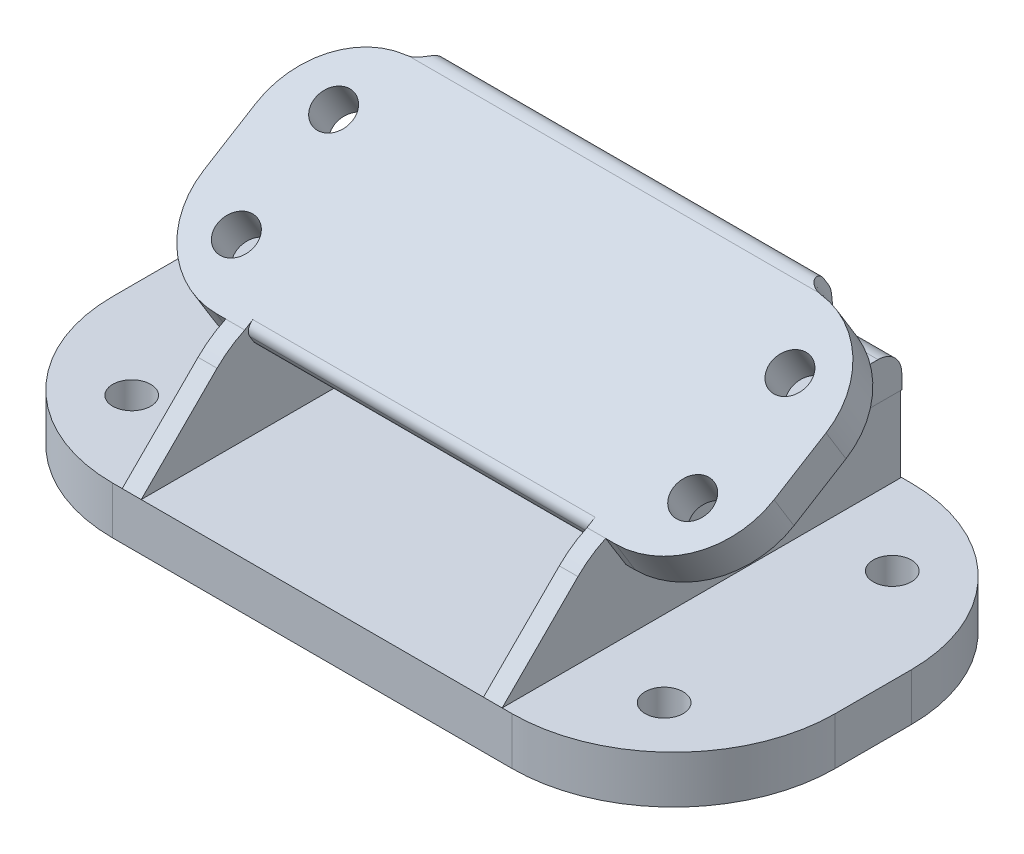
ISO-10303-21;
HEADER;
FILE_DESCRIPTION(('STEP AP214'),'2;1');
FILE_NAME('part.step','',(''),(''),'','','');
FILE_SCHEMA(('AUTOMOTIVE_DESIGN { 1 0 10303 214 1 1 1 1 }'));
ENDSEC;
DATA;
#1=APPLICATION_CONTEXT('core data for automotive mechanical design processes');
#2=APPLICATION_PROTOCOL_DEFINITION('international standard','automotive_design',2000,#1);
#3=PRODUCT_CONTEXT('',#1,'mechanical');
#4=PRODUCT('Part','Part','',(#3));
#5=PRODUCT_RELATED_PRODUCT_CATEGORY('part','',(#4));
#6=PRODUCT_DEFINITION_FORMATION('','',#4);
#7=PRODUCT_DEFINITION_CONTEXT('part definition',#1,'design');
#8=PRODUCT_DEFINITION('design','',#6,#7);
#9=PRODUCT_DEFINITION_SHAPE('','',#8);
#10=(LENGTH_UNIT() NAMED_UNIT(*) SI_UNIT(.MILLI.,.METRE.));
#11=(NAMED_UNIT(*) PLANE_ANGLE_UNIT() SI_UNIT($,.RADIAN.));
#12=(NAMED_UNIT(*) SI_UNIT($,.STERADIAN.) SOLID_ANGLE_UNIT());
#13=UNCERTAINTY_MEASURE_WITH_UNIT(LENGTH_MEASURE(1.E-05),#10,'distance_accuracy_value','');
#14=(GEOMETRIC_REPRESENTATION_CONTEXT(3) GLOBAL_UNCERTAINTY_ASSIGNED_CONTEXT((#13)) GLOBAL_UNIT_ASSIGNED_CONTEXT((#10,
#11,#12)) REPRESENTATION_CONTEXT('',''));
#15=CARTESIAN_POINT('',(0.,0.,0.));
#16=DIRECTION('',(0.,0.,1.));
#17=DIRECTION('',(1.,0.,0.));
#18=AXIS2_PLACEMENT_3D('',#15,#16,#17);
#19=CARTESIAN_POINT('',(20.,0.,0.));
#20=DIRECTION('',(-1.,0.,0.));
#21=DIRECTION('',(0.,0.,-1.));
#22=AXIS2_PLACEMENT_3D('',#19,#20,#21);
#23=PLANE('',#22);
#24=CARTESIAN_POINT('',(20.,25.6173161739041,-12.0273588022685));
#25=DIRECTION('',(-1.,0.,0.));
#26=DIRECTION('',(0.,0.,1.));
#27=AXIS2_PLACEMENT_3D('',#24,#25,#26);
#28=CIRCLE('',#27,1.5);
#29=CARTESIAN_POINT('',(20.,24.3384642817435,-12.8112834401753));
#30=VERTEX_POINT('',#29);
#31=CARTESIAN_POINT('',(20.,24.4703022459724,-12.9939812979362));
#32=VERTEX_POINT('',#31);
#33=EDGE_CURVE('E630',#30,#32,#28,.F.);
#34=ORIENTED_EDGE('',*,*,#33,.T.);
#35=DIRECTION('',(0.,0.522616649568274,-0.852567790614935));
#36=VECTOR('',#35,1.);
#37=CARTESIAN_POINT('',(20.,11.5897288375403,8.01867113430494));
#38=LINE('',#37,#36);
#39=CARTESIAN_POINT('',(20.,13.,5.71803304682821));
#40=VERTEX_POINT('',#39);
#41=EDGE_CURVE('E355',#40,#32,#38,.T.);
#42=ORIENTED_EDGE('',*,*,#41,.F.);
#43=DIRECTION('',(0.,0.,-1.));
#44=VECTOR('',#43,1.);
#45=CARTESIAN_POINT('',(20.,13.,0.));
#46=LINE('',#45,#44);
#47=CARTESIAN_POINT('',(20.,13.,-21.));
#48=VERTEX_POINT('',#47);
#49=EDGE_CURVE('E384',#40,#48,#46,.T.);
#50=ORIENTED_EDGE('',*,*,#49,.T.);
#51=DIRECTION('',(0.,1.,0.));
#52=VECTOR('',#51,1.);
#53=CARTESIAN_POINT('',(20.,0.,-21.));
#54=LINE('',#53,#52);
#55=CARTESIAN_POINT('',(20.,14.5,-21.));
#56=VERTEX_POINT('',#55);
#57=EDGE_CURVE('E380',#48,#56,#54,.T.);
#58=ORIENTED_EDGE('',*,*,#57,.T.);
#59=CARTESIAN_POINT('',(20.,14.5,-18.5));
#60=DIRECTION('',(-1.,0.,0.));
#61=DIRECTION('',(0.,0.,1.));
#62=AXIS2_PLACEMENT_3D('',#59,#60,#61);
#63=CIRCLE('',#62,2.5);
#64=CARTESIAN_POINT('',(20.,17.,-18.5));
#65=VERTEX_POINT('',#64);
#66=EDGE_CURVE('E613',#56,#65,#63,.F.);
#67=ORIENTED_EDGE('',*,*,#66,.T.);
#68=DIRECTION('',(0.,0.,1.));
#69=VECTOR('',#68,1.);
#70=CARTESIAN_POINT('',(20.,17.,0.));
#71=LINE('',#70,#69);
#72=CARTESIAN_POINT('',(20.,17.,-4.3845078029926));
#73=VERTEX_POINT('',#72);
#74=EDGE_CURVE('E377',#65,#73,#71,.T.);
#75=ORIENTED_EDGE('',*,*,#74,.T.);
#76=CARTESIAN_POINT('',(20.,18.,-4.3845078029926));
#77=DIRECTION('',(-1.,0.,0.));
#78=DIRECTION('',(0.,0.,1.));
#79=AXIS2_PLACEMENT_3D('',#76,#77,#78);
#80=CIRCLE('',#79,1.);
#81=CARTESIAN_POINT('',(20.,18.8525679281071,-3.86189137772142));
#82=VERTEX_POINT('',#81);
#83=EDGE_CURVE('E651',#73,#82,#80,.T.);
#84=ORIENTED_EDGE('',*,*,#83,.T.);
#85=DIRECTION('',(0.,-0.522616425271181,0.852567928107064));
#86=VECTOR('',#85,1.);
#87=CARTESIAN_POINT('',(20.,11.9826776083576,7.34527294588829));
#88=LINE('',#87,#86);
#89=EDGE_CURVE('E373',#30,#82,#88,.T.);
#90=ORIENTED_EDGE('',*,*,#89,.F.);
#91=EDGE_LOOP('',(#34,#42,#50,#58,#67,#75,#84,#90));
#92=FACE_BOUND('',#91,.T.);
#93=ADVANCED_FACE('F42',(#92),#23,.F.);
#94=CARTESIAN_POINT('',(19.9625712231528,15.,0.));
#95=DIRECTION('',(-1.,0.,0.));
#96=DIRECTION('',(0.,0.,1.));
#97=AXIS2_PLACEMENT_3D('',#94,#95,#96);
#98=PLANE('',#97);
#99=DIRECTION('',(0.,-0.852567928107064,-0.522616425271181));
#100=VECTOR('',#99,1.);
#101=CARTESIAN_POINT('',(19.9625712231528,10.4957119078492,7.34804989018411));
#102=LINE('',#101,#100);
#103=CARTESIAN_POINT('',(19.9625712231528,15.,10.109137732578));
#104=VERTEX_POINT('',#103);
#105=CARTESIAN_POINT('',(19.9625712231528,13.,8.88315583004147));
#106=VERTEX_POINT('',#105);
#107=EDGE_CURVE('E407',#104,#106,#102,.T.);
#108=ORIENTED_EDGE('',*,*,#107,.F.);
#109=CARTESIAN_POINT('',(19.9625712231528,5.90435550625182,5.95350887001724));
#110=DIRECTION('',(-1.,0.,0.));
#111=DIRECTION('',(0.,0.,1.));
#112=AXIS2_PLACEMENT_3D('',#109,#110,#111);
#113=CIRCLE('',#112,10.);
#114=CARTESIAN_POINT('',(19.9625712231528,12.9754233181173,13.0245766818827));
#115=VERTEX_POINT('',#114);
#116=EDGE_CURVE('E589',#104,#115,#113,.F.);
#117=ORIENTED_EDGE('',*,*,#116,.T.);
#118=DIRECTION('',(0.,0.707106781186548,-0.707106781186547));
#119=VECTOR('',#118,1.);
#120=CARTESIAN_POINT('',(19.9625712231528,15.,11.));
#121=LINE('',#120,#119);
#122=CARTESIAN_POINT('',(19.9625712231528,5.,21.));
#123=VERTEX_POINT('',#122);
#124=EDGE_CURVE('E581',#115,#123,#121,.F.);
#125=ORIENTED_EDGE('',*,*,#124,.T.);
#126=DIRECTION('',(0.,0.,-1.));
#127=VECTOR('',#126,1.);
#128=CARTESIAN_POINT('',(19.9625712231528,5.,0.));
#129=LINE('',#128,#127);
#130=CARTESIAN_POINT('',(19.9625712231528,5.,-20.9000470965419));
#131=VERTEX_POINT('',#130);
#132=EDGE_CURVE('E468',#123,#131,#129,.T.);
#133=ORIENTED_EDGE('',*,*,#132,.T.);
#134=DIRECTION('',(0.,-1.,0.));
#135=VECTOR('',#134,1.);
#136=CARTESIAN_POINT('',(19.9625712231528,15.,-20.9000470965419));
#137=LINE('',#136,#135);
#138=CARTESIAN_POINT('',(19.9625712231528,13.,-20.9000470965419));
#139=VERTEX_POINT('',#138);
#140=EDGE_CURVE('E483',#139,#131,#137,.T.);
#141=ORIENTED_EDGE('',*,*,#140,.F.);
#142=DIRECTION('',(0.,0.,-1.));
#143=VECTOR('',#142,1.);
#144=CARTESIAN_POINT('',(19.9625712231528,13.,0.));
#145=LINE('',#144,#143);
#146=EDGE_CURVE('E400',#106,#139,#145,.T.);
#147=ORIENTED_EDGE('',*,*,#146,.F.);
#148=EDGE_LOOP('',(#108,#117,#125,#133,#141,#147));
#149=FACE_BOUND('',#148,.T.);
#150=ADVANCED_FACE('F834',(#149),#98,.F.);
#151=CARTESIAN_POINT('',(0.,15.,-20.9000470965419));
#152=DIRECTION('',(0.,0.,-1.));
#153=DIRECTION('',(-1.,0.,0.));
#154=AXIS2_PLACEMENT_3D('',#151,#152,#153);
#155=PLANE('',#154);
#156=DIRECTION('',(0.,-1.,0.));
#157=VECTOR('',#156,1.);
#158=CARTESIAN_POINT('',(18.,15.,-20.9000470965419));
#159=LINE('',#158,#157);
#160=CARTESIAN_POINT('',(18.,13.,-20.9000470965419));
#161=VERTEX_POINT('',#160);
#162=CARTESIAN_POINT('',(18.,5.,-20.9000470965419));
#163=VERTEX_POINT('',#162);
#164=EDGE_CURVE('E480',#161,#163,#159,.T.);
#165=ORIENTED_EDGE('',*,*,#164,.F.);
#166=DIRECTION('',(1.,0.,0.));
#167=VECTOR('',#166,1.);
#168=CARTESIAN_POINT('',(0.,13.,-20.9000470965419));
#169=LINE('',#168,#167);
#170=EDGE_CURVE('E396',#161,#139,#169,.T.);
#171=ORIENTED_EDGE('',*,*,#170,.T.);
#172=ORIENTED_EDGE('',*,*,#140,.T.);
#173=DIRECTION('',(1.,0.,0.));
#174=VECTOR('',#173,1.);
#175=CARTESIAN_POINT('',(0.,5.,-20.9000470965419));
#176=LINE('',#175,#174);
#177=EDGE_CURVE('E472',#163,#131,#176,.T.);
#178=ORIENTED_EDGE('',*,*,#177,.F.);
#179=EDGE_LOOP('',(#165,#171,#172,#178));
#180=FACE_BOUND('',#179,.T.);
#181=ADVANCED_FACE('F839',(#180),#155,.T.);
#182=CARTESIAN_POINT('',(18.,15.,0.));
#183=DIRECTION('',(-1.,0.,0.));
#184=DIRECTION('',(0.,0.,1.));
#185=AXIS2_PLACEMENT_3D('',#182,#183,#184);
#186=PLANE('',#185);
#187=DIRECTION('',(0.,-0.707106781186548,0.707106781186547));
#188=VECTOR('',#187,1.);
#189=CARTESIAN_POINT('',(18.,20.5,5.50000000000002));
#190=LINE('',#189,#188);
#191=CARTESIAN_POINT('',(18.,5.,21.));
#192=VERTEX_POINT('',#191);
#193=CARTESIAN_POINT('',(18.,12.9754233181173,13.0245766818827));
#194=VERTEX_POINT('',#193);
#195=EDGE_CURVE('E585',#192,#194,#190,.F.);
#196=ORIENTED_EDGE('',*,*,#195,.T.);
#197=CARTESIAN_POINT('',(18.,5.90435550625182,5.95350887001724));
#198=DIRECTION('',(-1.,0.,0.));
#199=DIRECTION('',(0.,0.,1.));
#200=AXIS2_PLACEMENT_3D('',#197,#198,#199);
#201=CIRCLE('',#200,10.);
#202=CARTESIAN_POINT('',(18.,15.,10.109137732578));
#203=VERTEX_POINT('',#202);
#204=EDGE_CURVE('E595',#194,#203,#201,.T.);
#205=ORIENTED_EDGE('',*,*,#204,.T.);
#206=DIRECTION('',(0.,-0.522616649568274,0.852567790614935));
#207=VECTOR('',#206,1.);
#208=CARTESIAN_POINT('',(18.,19.5042892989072,2.76109021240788));
#209=LINE('',#208,#207);
#210=CARTESIAN_POINT('',(18.,15.5226165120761,9.25657016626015));
#211=VERTEX_POINT('',#210);
#212=EDGE_CURVE('E721',#211,#203,#209,.T.);
#213=ORIENTED_EDGE('',*,*,#212,.F.);
#214=CARTESIAN_POINT('',(18.,14.6700487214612,8.73395351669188));
#215=DIRECTION('',(-1.,0.,0.));
#216=DIRECTION('',(0.,0.,1.));
#217=AXIS2_PLACEMENT_3D('',#214,#215,#216);
#218=CIRCLE('',#217,1.);
#219=CARTESIAN_POINT('',(18.,14.14743229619,9.58652144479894));
#220=VERTEX_POINT('',#219);
#221=EDGE_CURVE('E730',#211,#220,#218,.F.);
#222=ORIENTED_EDGE('',*,*,#221,.T.);
#223=DIRECTION('',(0.,-0.852567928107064,-0.522616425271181));
#224=VECTOR('',#223,1.);
#225=CARTESIAN_POINT('',(18.,10.4957119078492,7.34804989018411));
#226=LINE('',#225,#224);
#227=CARTESIAN_POINT('',(18.,13.4773835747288,9.17578764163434));
#228=VERTEX_POINT('',#227);
#229=EDGE_CURVE('E403',#220,#228,#226,.T.);
#230=ORIENTED_EDGE('',*,*,#229,.T.);
#231=CARTESIAN_POINT('',(18.,14.,8.32321971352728));
#232=DIRECTION('',(-1.,0.,0.));
#233=DIRECTION('',(0.,0.,1.));
#234=AXIS2_PLACEMENT_3D('',#231,#232,#233);
#235=CIRCLE('',#234,1.);
#236=CARTESIAN_POINT('',(18.,13.,8.32321971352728));
#237=VERTEX_POINT('',#236);
#238=EDGE_CURVE('E724',#228,#237,#235,.F.);
#239=ORIENTED_EDGE('',*,*,#238,.T.);
#240=DIRECTION('',(0.,0.,-1.));
#241=VECTOR('',#240,1.);
#242=CARTESIAN_POINT('',(18.,13.,0.));
#243=LINE('',#242,#241);
#244=EDGE_CURVE('E390',#237,#161,#243,.T.);
#245=ORIENTED_EDGE('',*,*,#244,.T.);
#246=ORIENTED_EDGE('',*,*,#164,.T.);
#247=DIRECTION('',(0.,0.,1.));
#248=VECTOR('',#247,1.);
#249=CARTESIAN_POINT('',(18.,5.,0.));
#250=LINE('',#249,#248);
#251=CARTESIAN_POINT('',(18.,5.,-21.));
#252=VERTEX_POINT('',#251);
#253=EDGE_CURVE('E443',#252,#163,#250,.T.);
#254=ORIENTED_EDGE('',*,*,#253,.F.);
#255=DIRECTION('',(0.,1.,0.));
#256=VECTOR('',#255,1.);
#257=CARTESIAN_POINT('',(18.,0.,-21.));
#258=LINE('',#257,#256);
#259=CARTESIAN_POINT('',(18.,3.194544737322,-21.));
#260=VERTEX_POINT('',#259);
#261=EDGE_CURVE('E447',#260,#252,#258,.T.);
#262=ORIENTED_EDGE('',*,*,#261,.F.);
#263=DIRECTION('',(0.,0.194143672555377,0.980973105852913));
#264=VECTOR('',#263,1.);
#265=CARTESIAN_POINT('',(18.,7.07358085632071,-1.39992723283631));
#266=LINE('',#265,#264);
#267=CARTESIAN_POINT('',(18.,3.25847774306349,-20.6769580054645));
#268=VERTEX_POINT('',#267);
#269=EDGE_CURVE('E434',#260,#268,#266,.T.);
#270=ORIENTED_EDGE('',*,*,#269,.T.);
#271=CARTESIAN_POINT('',(18.,-39.3941769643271,-7.60304461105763));
#272=DIRECTION('',(-1.,0.,0.));
#273=DIRECTION('',(0.,0.,1.));
#274=AXIS2_PLACEMENT_3D('',#271,#272,#273);
#275=CIRCLE('',#274,44.6113905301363);
#276=CARTESIAN_POINT('',(18.,5.,-12.));
#277=VERTEX_POINT('',#276);
#278=EDGE_CURVE('E438',#268,#277,#275,.F.);
#279=ORIENTED_EDGE('',*,*,#278,.T.);
#280=DIRECTION('',(0.,0.,-1.));
#281=VECTOR('',#280,1.);
#282=CARTESIAN_POINT('',(18.,5.,0.));
#283=LINE('',#282,#281);
#284=EDGE_CURVE('E476',#192,#277,#283,.T.);
#285=ORIENTED_EDGE('',*,*,#284,.F.);
#286=EDGE_LOOP('',(#196,#205,#213,#222,#230,#239,#245,#246,#254,#262,#270,#279,#285));
#287=FACE_BOUND('',#286,.T.);
#288=ADVANCED_FACE('F883',(#287),#186,.T.);
#289=CARTESIAN_POINT('',(0.,5.,0.));
#290=DIRECTION('',(0.,1.,0.));
#291=DIRECTION('',(0.,0.,1.));
#292=AXIS2_PLACEMENT_3D('',#289,#290,#291);
#293=PLANE('',#292);
#294=ORIENTED_EDGE('',*,*,#284,.T.);
#295=DIRECTION('',(-1.,0.,0.));
#296=VECTOR('',#295,1.);
#297=CARTESIAN_POINT('',(27.1793065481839,5.,-12.));
#298=LINE('',#297,#296);
#299=CARTESIAN_POINT('',(-18.,5.,-12.));
#300=VERTEX_POINT('',#299);
#301=EDGE_CURVE('E439',#277,#300,#298,.T.);
#302=ORIENTED_EDGE('',*,*,#301,.T.);
#303=DIRECTION('',(0.,0.,-1.));
#304=VECTOR('',#303,1.);
#305=CARTESIAN_POINT('',(-18.,5.,0.));
#306=LINE('',#305,#304);
#307=CARTESIAN_POINT('',(-18.,5.,21.));
#308=VERTEX_POINT('',#307);
#309=EDGE_CURVE('E490',#308,#300,#306,.T.);
#310=ORIENTED_EDGE('',*,*,#309,.F.);
#311=DIRECTION('',(-1.,0.,0.));
#312=VECTOR('',#311,1.);
#313=CARTESIAN_POINT('',(0.,5.,21.));
#314=LINE('',#313,#312);
#315=EDGE_CURVE('E505',#192,#308,#314,.T.);
#316=ORIENTED_EDGE('',*,*,#315,.F.);
#317=EDGE_LOOP('',(#294,#302,#310,#316));
#318=FACE_BOUND('',#317,.T.);
#319=ADVANCED_FACE('F886',(#318),#293,.T.);
#320=CARTESIAN_POINT('',(28.,5.,-12.));
#321=DIRECTION('',(0.,1.,0.));
#322=DIRECTION('',(0.,0.,1.));
#323=AXIS2_PLACEMENT_3D('',#320,#321,#322);
#324=CIRCLE('',#323,2.);
#325=CARTESIAN_POINT('',(28.,5.,-10.));
#326=VERTEX_POINT('',#325);
#327=EDGE_CURVE('E521',#326,#326,#324,.F.);
#328=ORIENTED_EDGE('',*,*,#327,.T.);
#329=EDGE_LOOP('',(#328));
#330=FACE_BOUND('',#329,.T.);
#331=CARTESIAN_POINT('',(28.,5.,12.));
#332=DIRECTION('',(0.,1.,0.));
#333=DIRECTION('',(0.,0.,1.));
#334=AXIS2_PLACEMENT_3D('',#331,#332,#333);
#335=CIRCLE('',#334,2.);
#336=CARTESIAN_POINT('',(28.,5.,14.));
#337=VERTEX_POINT('',#336);
#338=EDGE_CURVE('E517',#337,#337,#335,.F.);
#339=ORIENTED_EDGE('',*,*,#338,.T.);
#340=EDGE_LOOP('',(#339));
#341=FACE_BOUND('',#340,.T.);
#342=CARTESIAN_POINT('',(21.,5.,21.));
#343=VERTEX_POINT('',#342);
#344=EDGE_CURVE('E501',#343,#123,#314,.T.);
#345=ORIENTED_EDGE('',*,*,#344,.F.);
#346=CARTESIAN_POINT('',(21.,5.,3.99999999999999));
#347=DIRECTION('',(0.,1.,0.));
#348=DIRECTION('',(0.,0.,1.));
#349=AXIS2_PLACEMENT_3D('',#346,#347,#348);
#350=CIRCLE('',#349,17.);
#351=CARTESIAN_POINT('',(38.,5.,3.99999999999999));
#352=VERTEX_POINT('',#351);
#353=EDGE_CURVE('E1805',#343,#352,#350,.T.);
#354=ORIENTED_EDGE('',*,*,#353,.T.);
#355=DIRECTION('',(0.,0.,-1.));
#356=VECTOR('',#355,1.);
#357=CARTESIAN_POINT('',(38.,5.,0.));
#358=LINE('',#357,#356);
#359=CARTESIAN_POINT('',(38.,5.,-4.00000000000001));
#360=VERTEX_POINT('',#359);
#361=EDGE_CURVE('E504',#352,#360,#358,.T.);
#362=ORIENTED_EDGE('',*,*,#361,.T.);
#363=CARTESIAN_POINT('',(21.,5.,-4.00000000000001));
#364=DIRECTION('',(0.,1.,0.));
#365=DIRECTION('',(0.,0.,1.));
#366=AXIS2_PLACEMENT_3D('',#363,#364,#365);
#367=CIRCLE('',#366,17.);
#368=CARTESIAN_POINT('',(21.,5.,-21.));
#369=VERTEX_POINT('',#368);
#370=EDGE_CURVE('E1813',#360,#369,#367,.T.);
#371=ORIENTED_EDGE('',*,*,#370,.T.);
#372=DIRECTION('',(-1.,0.,0.));
#373=VECTOR('',#372,1.);
#374=CARTESIAN_POINT('',(0.,5.,-21.));
#375=LINE('',#374,#373);
#376=EDGE_CURVE('E511',#369,#252,#375,.T.);
#377=ORIENTED_EDGE('',*,*,#376,.T.);
#378=ORIENTED_EDGE('',*,*,#253,.T.);
#379=ORIENTED_EDGE('',*,*,#177,.T.);
#380=ORIENTED_EDGE('',*,*,#132,.F.);
#381=EDGE_LOOP('',(#345,#354,#362,#371,#377,#378,#379,#380));
#382=FACE_BOUND('',#381,.T.);
#383=ADVANCED_FACE('F903',(#330,#341,#382),#293,.T.);
#384=CARTESIAN_POINT('',(0.,5.,-21.));
#385=DIRECTION('',(0.,0.,1.));
#386=DIRECTION('',(1.,0.,0.));
#387=AXIS2_PLACEMENT_3D('',#384,#385,#386);
#388=PLANE('',#387);
#389=ORIENTED_EDGE('',*,*,#376,.F.);
#390=DIRECTION('',(0.,-1.,0.));
#391=VECTOR('',#390,1.);
#392=CARTESIAN_POINT('',(21.,5.,-21.));
#393=LINE('',#392,#391);
#394=CARTESIAN_POINT('',(21.,0.,-21.));
#395=VERTEX_POINT('',#394);
#396=EDGE_CURVE('E1817',#369,#395,#393,.T.);
#397=ORIENTED_EDGE('',*,*,#396,.T.);
#398=DIRECTION('',(-1.,0.,0.));
#399=VECTOR('',#398,1.);
#400=CARTESIAN_POINT('',(0.,0.,-21.));
#401=LINE('',#400,#399);
#402=CARTESIAN_POINT('',(-21.,0.,-21.));
#403=VERTEX_POINT('',#402);
#404=EDGE_CURVE('E541',#395,#403,#401,.T.);
#405=ORIENTED_EDGE('',*,*,#404,.T.);
#406=DIRECTION('',(0.,-1.,0.));
#407=VECTOR('',#406,1.);
#408=CARTESIAN_POINT('',(-21.,5.,-21.));
#409=LINE('',#408,#407);
#410=CARTESIAN_POINT('',(-21.,5.,-21.));
#411=VERTEX_POINT('',#410);
#412=EDGE_CURVE('E1812',#403,#411,#409,.F.);
#413=ORIENTED_EDGE('',*,*,#412,.T.);
#414=CARTESIAN_POINT('',(-20.,5.,-21.));
#415=VERTEX_POINT('',#414);
#416=EDGE_CURVE('E510',#415,#411,#375,.T.);
#417=ORIENTED_EDGE('',*,*,#416,.F.);
#418=DIRECTION('',(0.,-1.,0.));
#419=VECTOR('',#418,1.);
#420=CARTESIAN_POINT('',(-20.,15.,-21.));
#421=LINE('',#420,#419);
#422=CARTESIAN_POINT('',(-20.,14.5,-21.));
#423=VERTEX_POINT('',#422);
#424=EDGE_CURVE('E497',#423,#415,#421,.T.);
#425=ORIENTED_EDGE('',*,*,#424,.F.);
#426=DIRECTION('',(1.,0.,0.));
#427=VECTOR('',#426,1.);
#428=CARTESIAN_POINT('',(20.,14.5,-21.));
#429=LINE('',#428,#427);
#430=EDGE_CURVE('E609',#423,#56,#429,.T.);
#431=ORIENTED_EDGE('',*,*,#430,.T.);
#432=ORIENTED_EDGE('',*,*,#57,.F.);
#433=DIRECTION('',(1.,0.,0.));
#434=VECTOR('',#433,1.);
#435=CARTESIAN_POINT('',(-20.,13.,-21.));
#436=LINE('',#435,#434);
#437=CARTESIAN_POINT('',(-18.,13.,-21.));
#438=VERTEX_POINT('',#437);
#439=EDGE_CURVE('E422',#438,#48,#436,.T.);
#440=ORIENTED_EDGE('',*,*,#439,.F.);
#441=DIRECTION('',(0.,-1.,0.));
#442=VECTOR('',#441,1.);
#443=CARTESIAN_POINT('',(-18.,15.,-21.));
#444=LINE('',#443,#442);
#445=CARTESIAN_POINT('',(-18.,3.194544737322,-21.));
#446=VERTEX_POINT('',#445);
#447=EDGE_CURVE('E494',#438,#446,#444,.T.);
#448=ORIENTED_EDGE('',*,*,#447,.T.);
#449=DIRECTION('',(-1.,0.,0.));
#450=VECTOR('',#449,1.);
#451=CARTESIAN_POINT('',(27.1793065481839,3.194544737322,-21.));
#452=LINE('',#451,#450);
#453=EDGE_CURVE('E455',#260,#446,#452,.T.);
#454=ORIENTED_EDGE('',*,*,#453,.F.);
#455=ORIENTED_EDGE('',*,*,#261,.T.);
#456=EDGE_LOOP('',(#389,#397,#405,#413,#417,#425,#431,#432,#440,#448,#454,#455));
#457=FACE_BOUND('',#456,.T.);
#458=ADVANCED_FACE('F926',(#457),#388,.F.);
#459=CARTESIAN_POINT('',(0.,5.,21.));
#460=DIRECTION('',(0.,0.,1.));
#461=DIRECTION('',(1.,0.,0.));
#462=AXIS2_PLACEMENT_3D('',#459,#460,#461);
#463=PLANE('',#462);
#464=DIRECTION('',(-1.,0.,0.));
#465=VECTOR('',#464,1.);
#466=CARTESIAN_POINT('',(0.,0.,21.));
#467=LINE('',#466,#465);
#468=CARTESIAN_POINT('',(21.,0.,21.));
#469=VERTEX_POINT('',#468);
#470=CARTESIAN_POINT('',(-21.,0.,21.));
#471=VERTEX_POINT('',#470);
#472=EDGE_CURVE('E500',#469,#471,#467,.T.);
#473=ORIENTED_EDGE('',*,*,#472,.F.);
#474=DIRECTION('',(0.,-1.,0.));
#475=VECTOR('',#474,1.);
#476=CARTESIAN_POINT('',(21.,5.,21.));
#477=LINE('',#476,#475);
#478=EDGE_CURVE('E1809',#469,#343,#477,.F.);
#479=ORIENTED_EDGE('',*,*,#478,.T.);
#480=ORIENTED_EDGE('',*,*,#344,.T.);
#481=DIRECTION('',(-1.,0.,0.));
#482=VECTOR('',#481,1.);
#483=CARTESIAN_POINT('',(0.,5.,21.));
#484=LINE('',#483,#482);
#485=EDGE_CURVE('E571',#123,#192,#484,.T.);
#486=ORIENTED_EDGE('',*,*,#485,.T.);
#487=ORIENTED_EDGE('',*,*,#315,.T.);
#488=DIRECTION('',(-1.,0.,0.));
#489=VECTOR('',#488,1.);
#490=CARTESIAN_POINT('',(0.,5.,21.));
#491=LINE('',#490,#489);
#492=CARTESIAN_POINT('',(-20.,5.,21.));
#493=VERTEX_POINT('',#492);
#494=EDGE_CURVE('E574',#308,#493,#491,.T.);
#495=ORIENTED_EDGE('',*,*,#494,.T.);
#496=CARTESIAN_POINT('',(-21.,5.,21.));
#497=VERTEX_POINT('',#496);
#498=EDGE_CURVE('E506',#493,#497,#314,.T.);
#499=ORIENTED_EDGE('',*,*,#498,.T.);
#500=DIRECTION('',(0.,-1.,0.));
#501=VECTOR('',#500,1.);
#502=CARTESIAN_POINT('',(-21.,5.,21.));
#503=LINE('',#502,#501);
#504=EDGE_CURVE('E1831',#497,#471,#503,.T.);
#505=ORIENTED_EDGE('',*,*,#504,.T.);
#506=EDGE_LOOP('',(#473,#479,#480,#486,#487,#495,#499,#505));
#507=FACE_BOUND('',#506,.T.);
#508=ADVANCED_FACE('F929',(#507),#463,.T.);
#509=CARTESIAN_POINT('',(38.,5.,0.));
#510=DIRECTION('',(-1.,0.,0.));
#511=DIRECTION('',(0.,0.,1.));
#512=AXIS2_PLACEMENT_3D('',#509,#510,#511);
#513=PLANE('',#512);
#514=ORIENTED_EDGE('',*,*,#361,.F.);
#515=DIRECTION('',(0.,-1.,0.));
#516=VECTOR('',#515,1.);
#517=CARTESIAN_POINT('',(38.,0.,3.99999999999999));
#518=LINE('',#517,#516);
#519=CARTESIAN_POINT('',(38.,0.,3.99999999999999));
#520=VERTEX_POINT('',#519);
#521=EDGE_CURVE('E1811',#352,#520,#518,.T.);
#522=ORIENTED_EDGE('',*,*,#521,.T.);
#523=DIRECTION('',(0.,0.,-1.));
#524=VECTOR('',#523,1.);
#525=CARTESIAN_POINT('',(38.,0.,0.));
#526=LINE('',#525,#524);
#527=CARTESIAN_POINT('',(38.,0.,-4.00000000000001));
#528=VERTEX_POINT('',#527);
#529=EDGE_CURVE('E537',#520,#528,#526,.T.);
#530=ORIENTED_EDGE('',*,*,#529,.T.);
#531=DIRECTION('',(0.,-1.,0.));
#532=VECTOR('',#531,1.);
#533=CARTESIAN_POINT('',(38.,5.,-4.00000000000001));
#534=LINE('',#533,#532);
#535=EDGE_CURVE('E815',#528,#360,#534,.F.);
#536=ORIENTED_EDGE('',*,*,#535,.T.);
#537=EDGE_LOOP('',(#514,#522,#530,#536));
#538=FACE_BOUND('',#537,.T.);
#539=ADVANCED_FACE('F915',(#538),#513,.F.);
#540=CARTESIAN_POINT('',(-28.,5.,-12.));
#541=DIRECTION('',(0.,-1.,0.));
#542=DIRECTION('',(0.,0.,-1.));
#543=AXIS2_PLACEMENT_3D('',#540,#541,#542);
#544=CYLINDRICAL_SURFACE('',#543,2.);
#545=CARTESIAN_POINT('',(-28.,5.,-12.));
#546=DIRECTION('',(0.,1.,0.));
#547=DIRECTION('',(0.,0.,1.));
#548=AXIS2_PLACEMENT_3D('',#545,#546,#547);
#549=CIRCLE('',#548,2.);
#550=CARTESIAN_POINT('',(-28.,5.,-10.));
#551=VERTEX_POINT('',#550);
#552=EDGE_CURVE('E525',#551,#551,#549,.T.);
#553=ORIENTED_EDGE('',*,*,#552,.T.);
#554=EDGE_LOOP('',(#553));
#555=FACE_BOUND('',#554,.T.);
#556=CARTESIAN_POINT('',(-28.,0.,-12.));
#557=DIRECTION('',(0.,1.,0.));
#558=DIRECTION('',(0.,0.,1.));
#559=AXIS2_PLACEMENT_3D('',#556,#557,#558);
#560=CIRCLE('',#559,2.);
#561=CARTESIAN_POINT('',(-28.,0.,-10.));
#562=VERTEX_POINT('',#561);
#563=EDGE_CURVE('E557',#562,#562,#560,.T.);
#564=ORIENTED_EDGE('',*,*,#563,.F.);
#565=EDGE_LOOP('',(#564));
#566=FACE_BOUND('',#565,.T.);
#567=ADVANCED_FACE('F911',(#555,#566),#544,.F.);
#568=CARTESIAN_POINT('',(28.,5.,-12.));
#569=DIRECTION('',(0.,-1.,0.));
#570=DIRECTION('',(0.,0.,-1.));
#571=AXIS2_PLACEMENT_3D('',#568,#569,#570);
#572=CYLINDRICAL_SURFACE('',#571,2.);
#573=ORIENTED_EDGE('',*,*,#327,.F.);
#574=EDGE_LOOP('',(#573));
#575=FACE_BOUND('',#574,.T.);
#576=CARTESIAN_POINT('',(28.,0.,-12.));
#577=DIRECTION('',(0.,1.,0.));
#578=DIRECTION('',(0.,0.,1.));
#579=AXIS2_PLACEMENT_3D('',#576,#577,#578);
#580=CIRCLE('',#579,2.);
#581=CARTESIAN_POINT('',(28.,0.,-10.));
#582=VERTEX_POINT('',#581);
#583=EDGE_CURVE('E553',#582,#582,#580,.F.);
#584=ORIENTED_EDGE('',*,*,#583,.T.);
#585=EDGE_LOOP('',(#584));
#586=FACE_BOUND('',#585,.T.);
#587=ADVANCED_FACE('F914',(#575,#586),#572,.F.);
#588=CARTESIAN_POINT('',(28.,5.,12.));
#589=DIRECTION('',(0.,-1.,0.));
#590=DIRECTION('',(0.,0.,-1.));
#591=AXIS2_PLACEMENT_3D('',#588,#589,#590);
#592=CYLINDRICAL_SURFACE('',#591,2.);
#593=ORIENTED_EDGE('',*,*,#338,.F.);
#594=EDGE_LOOP('',(#593));
#595=FACE_BOUND('',#594,.T.);
#596=CARTESIAN_POINT('',(28.,0.,12.));
#597=DIRECTION('',(0.,1.,0.));
#598=DIRECTION('',(0.,0.,1.));
#599=AXIS2_PLACEMENT_3D('',#596,#597,#598);
#600=CIRCLE('',#599,2.);
#601=CARTESIAN_POINT('',(28.,0.,14.));
#602=VERTEX_POINT('',#601);
#603=EDGE_CURVE('E549',#602,#602,#600,.F.);
#604=ORIENTED_EDGE('',*,*,#603,.T.);
#605=EDGE_LOOP('',(#604));
#606=FACE_BOUND('',#605,.T.);
#607=ADVANCED_FACE('F919',(#595,#606),#592,.F.);
#608=CARTESIAN_POINT('',(-38.,5.,0.));
#609=DIRECTION('',(-1.,0.,0.));
#610=DIRECTION('',(0.,0.,1.));
#611=AXIS2_PLACEMENT_3D('',#608,#609,#610);
#612=PLANE('',#611);
#613=DIRECTION('',(0.,0.,-1.));
#614=VECTOR('',#613,1.);
#615=CARTESIAN_POINT('',(-38.,5.,0.));
#616=LINE('',#615,#614);
#617=CARTESIAN_POINT('',(-38.,5.,3.99999999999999));
#618=VERTEX_POINT('',#617);
#619=CARTESIAN_POINT('',(-38.,5.,-4.00000000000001));
#620=VERTEX_POINT('',#619);
#621=EDGE_CURVE('E514',#618,#620,#616,.T.);
#622=ORIENTED_EDGE('',*,*,#621,.T.);
#623=DIRECTION('',(0.,-1.,0.));
#624=VECTOR('',#623,1.);
#625=CARTESIAN_POINT('',(-38.,0.,-4.00000000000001));
#626=LINE('',#625,#624);
#627=CARTESIAN_POINT('',(-38.,0.,-4.00000000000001));
#628=VERTEX_POINT('',#627);
#629=EDGE_CURVE('E1827',#620,#628,#626,.T.);
#630=ORIENTED_EDGE('',*,*,#629,.T.);
#631=DIRECTION('',(0.,0.,-1.));
#632=VECTOR('',#631,1.);
#633=CARTESIAN_POINT('',(-38.,0.,0.));
#634=LINE('',#633,#632);
#635=CARTESIAN_POINT('',(-38.,0.,3.99999999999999));
#636=VERTEX_POINT('',#635);
#637=EDGE_CURVE('E545',#636,#628,#634,.T.);
#638=ORIENTED_EDGE('',*,*,#637,.F.);
#639=DIRECTION('',(0.,-1.,0.));
#640=VECTOR('',#639,1.);
#641=CARTESIAN_POINT('',(-38.,5.,3.99999999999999));
#642=LINE('',#641,#640);
#643=EDGE_CURVE('E63',#636,#618,#642,.F.);
#644=ORIENTED_EDGE('',*,*,#643,.T.);
#645=EDGE_LOOP('',(#622,#630,#638,#644));
#646=FACE_BOUND('',#645,.T.);
#647=ADVANCED_FACE('F909',(#646),#612,.T.);
#648=CARTESIAN_POINT('',(-28.,5.,12.));
#649=DIRECTION('',(0.,-1.,0.));
#650=DIRECTION('',(0.,0.,-1.));
#651=AXIS2_PLACEMENT_3D('',#648,#649,#650);
#652=CYLINDRICAL_SURFACE('',#651,2.);
#653=CARTESIAN_POINT('',(-28.,5.,12.));
#654=DIRECTION('',(0.,1.,0.));
#655=DIRECTION('',(0.,0.,1.));
#656=AXIS2_PLACEMENT_3D('',#653,#654,#655);
#657=CIRCLE('',#656,2.);
#658=CARTESIAN_POINT('',(-28.,5.,14.));
#659=VERTEX_POINT('',#658);
#660=EDGE_CURVE('E529',#659,#659,#657,.T.);
#661=ORIENTED_EDGE('',*,*,#660,.T.);
#662=EDGE_LOOP('',(#661));
#663=FACE_BOUND('',#662,.T.);
#664=CARTESIAN_POINT('',(-28.,0.,12.));
#665=DIRECTION('',(0.,1.,0.));
#666=DIRECTION('',(0.,0.,1.));
#667=AXIS2_PLACEMENT_3D('',#664,#665,#666);
#668=CIRCLE('',#667,2.);
#669=CARTESIAN_POINT('',(-28.,0.,14.));
#670=VERTEX_POINT('',#669);
#671=EDGE_CURVE('E561',#670,#670,#668,.T.);
#672=ORIENTED_EDGE('',*,*,#671,.F.);
#673=EDGE_LOOP('',(#672));
#674=FACE_BOUND('',#673,.T.);
#675=ADVANCED_FACE('F902',(#663,#674),#652,.F.);
#676=ORIENTED_EDGE('',*,*,#416,.T.);
#677=CARTESIAN_POINT('',(-21.,5.,-4.00000000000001));
#678=DIRECTION('',(0.,1.,0.));
#679=DIRECTION('',(0.,0.,1.));
#680=AXIS2_PLACEMENT_3D('',#677,#678,#679);
#681=CIRCLE('',#680,17.);
#682=EDGE_CURVE('E11',#411,#620,#681,.T.);
#683=ORIENTED_EDGE('',*,*,#682,.T.);
#684=ORIENTED_EDGE('',*,*,#621,.F.);
#685=CARTESIAN_POINT('',(-21.,5.,3.99999999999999));
#686=DIRECTION('',(0.,1.,0.));
#687=DIRECTION('',(0.,0.,1.));
#688=AXIS2_PLACEMENT_3D('',#685,#686,#687);
#689=CIRCLE('',#688,17.);
#690=EDGE_CURVE('E51',#618,#497,#689,.T.);
#691=ORIENTED_EDGE('',*,*,#690,.T.);
#692=ORIENTED_EDGE('',*,*,#498,.F.);
#693=DIRECTION('',(0.,0.,1.));
#694=VECTOR('',#693,1.);
#695=CARTESIAN_POINT('',(-20.,5.,0.));
#696=LINE('',#695,#694);
#697=EDGE_CURVE('E486',#415,#493,#696,.T.);
#698=ORIENTED_EDGE('',*,*,#697,.F.);
#699=EDGE_LOOP('',(#676,#683,#684,#691,#692,#698));
#700=FACE_BOUND('',#699,.T.);
#701=ORIENTED_EDGE('',*,*,#552,.F.);
#702=EDGE_LOOP('',(#701));
#703=FACE_BOUND('',#702,.T.);
#704=ORIENTED_EDGE('',*,*,#660,.F.);
#705=EDGE_LOOP('',(#704));
#706=FACE_BOUND('',#705,.T.);
#707=ADVANCED_FACE('F899',(#700,#703,#706),#293,.T.);
#708=CARTESIAN_POINT('',(0.,0.,0.));
#709=DIRECTION('',(0.,1.,0.));
#710=DIRECTION('',(0.,0.,1.));
#711=AXIS2_PLACEMENT_3D('',#708,#709,#710);
#712=PLANE('',#711);
#713=ORIENTED_EDGE('',*,*,#529,.F.);
#714=CARTESIAN_POINT('',(21.,0.,3.99999999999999));
#715=DIRECTION('',(0.,1.,0.));
#716=DIRECTION('',(0.,0.,1.));
#717=AXIS2_PLACEMENT_3D('',#714,#715,#716);
#718=CIRCLE('',#717,17.);
#719=EDGE_CURVE('E1873',#520,#469,#718,.F.);
#720=ORIENTED_EDGE('',*,*,#719,.T.);
#721=ORIENTED_EDGE('',*,*,#472,.T.);
#722=CARTESIAN_POINT('',(-21.,0.,3.99999999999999));
#723=DIRECTION('',(0.,1.,0.));
#724=DIRECTION('',(0.,0.,1.));
#725=AXIS2_PLACEMENT_3D('',#722,#723,#724);
#726=CIRCLE('',#725,17.);
#727=EDGE_CURVE('E1885',#471,#636,#726,.F.);
#728=ORIENTED_EDGE('',*,*,#727,.T.);
#729=ORIENTED_EDGE('',*,*,#637,.T.);
#730=CARTESIAN_POINT('',(-21.,0.,-4.00000000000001));
#731=DIRECTION('',(0.,1.,0.));
#732=DIRECTION('',(0.,0.,1.));
#733=AXIS2_PLACEMENT_3D('',#730,#731,#732);
#734=CIRCLE('',#733,17.);
#735=EDGE_CURVE('E1880',#628,#403,#734,.F.);
#736=ORIENTED_EDGE('',*,*,#735,.T.);
#737=ORIENTED_EDGE('',*,*,#404,.F.);
#738=CARTESIAN_POINT('',(21.,0.,-4.00000000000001));
#739=DIRECTION('',(0.,1.,0.));
#740=DIRECTION('',(0.,0.,1.));
#741=AXIS2_PLACEMENT_3D('',#738,#739,#740);
#742=CIRCLE('',#741,17.);
#743=EDGE_CURVE('E1874',#395,#528,#742,.F.);
#744=ORIENTED_EDGE('',*,*,#743,.T.);
#745=EDGE_LOOP('',(#713,#720,#721,#728,#729,#736,#737,#744));
#746=FACE_BOUND('',#745,.T.);
#747=ORIENTED_EDGE('',*,*,#603,.F.);
#748=EDGE_LOOP('',(#747));
#749=FACE_BOUND('',#748,.T.);
#750=ORIENTED_EDGE('',*,*,#583,.F.);
#751=EDGE_LOOP('',(#750));
#752=FACE_BOUND('',#751,.T.);
#753=ORIENTED_EDGE('',*,*,#563,.T.);
#754=EDGE_LOOP('',(#753));
#755=FACE_BOUND('',#754,.T.);
#756=ORIENTED_EDGE('',*,*,#671,.T.);
#757=EDGE_LOOP('',(#756));
#758=FACE_BOUND('',#757,.T.);
#759=ADVANCED_FACE('F897',(#746,#749,#752,#755,#758),#712,.F.);
#760=CARTESIAN_POINT('',(-20.,15.,0.));
#761=DIRECTION('',(1.,0.,0.));
#762=DIRECTION('',(0.,0.,-1.));
#763=AXIS2_PLACEMENT_3D('',#760,#761,#762);
#764=PLANE('',#763);
#765=DIRECTION('',(0.,0.522616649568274,-0.852567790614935));
#766=VECTOR('',#765,1.);
#767=CARTESIAN_POINT('',(-20.,11.5897288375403,8.01867113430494));
#768=LINE('',#767,#766);
#769=CARTESIAN_POINT('',(-20.,11.5897288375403,8.01867113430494));
#770=VERTEX_POINT('',#769);
#771=CARTESIAN_POINT('',(-20.,24.4703022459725,-12.9939812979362));
#772=VERTEX_POINT('',#771);
#773=EDGE_CURVE('E1060',#770,#772,#768,.T.);
#774=ORIENTED_EDGE('',*,*,#773,.T.);
#775=CARTESIAN_POINT('',(-20.,25.6173161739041,-12.0273588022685));
#776=DIRECTION('',(1.,0.,0.));
#777=DIRECTION('',(0.,0.,-1.));
#778=AXIS2_PLACEMENT_3D('',#775,#776,#777);
#779=CIRCLE('',#778,1.5);
#780=CARTESIAN_POINT('',(-20.,24.3384642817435,-12.8112834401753));
#781=VERTEX_POINT('',#780);
#782=EDGE_CURVE('E637',#772,#781,#779,.F.);
#783=ORIENTED_EDGE('',*,*,#782,.T.);
#784=DIRECTION('',(0.,-0.522616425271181,0.852567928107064));
#785=VECTOR('',#784,1.);
#786=CARTESIAN_POINT('',(-20.,11.9826776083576,7.34527294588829));
#787=LINE('',#786,#785);
#788=CARTESIAN_POINT('',(-20.,18.8525679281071,-3.86189137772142));
#789=VERTEX_POINT('',#788);
#790=EDGE_CURVE('E414',#781,#789,#787,.T.);
#791=ORIENTED_EDGE('',*,*,#790,.T.);
#792=CARTESIAN_POINT('',(-20.,18.,-4.3845078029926));
#793=DIRECTION('',(1.,0.,0.));
#794=DIRECTION('',(0.,0.,-1.));
#795=AXIS2_PLACEMENT_3D('',#792,#793,#794);
#796=CIRCLE('',#795,1.);
#797=CARTESIAN_POINT('',(-20.,17.,-4.3845078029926));
#798=VERTEX_POINT('',#797);
#799=EDGE_CURVE('E654',#789,#798,#796,.T.);
#800=ORIENTED_EDGE('',*,*,#799,.T.);
#801=DIRECTION('',(0.,0.,1.));
#802=VECTOR('',#801,1.);
#803=CARTESIAN_POINT('',(-20.,17.,0.));
#804=LINE('',#803,#802);
#805=CARTESIAN_POINT('',(-20.,17.,-18.5));
#806=VERTEX_POINT('',#805);
#807=EDGE_CURVE('E410',#806,#798,#804,.T.);
#808=ORIENTED_EDGE('',*,*,#807,.F.);
#809=CARTESIAN_POINT('',(-20.,14.5,-18.5));
#810=DIRECTION('',(1.,0.,0.));
#811=DIRECTION('',(0.,0.,-1.));
#812=AXIS2_PLACEMENT_3D('',#809,#810,#811);
#813=CIRCLE('',#812,2.5);
#814=EDGE_CURVE('E619',#806,#423,#813,.F.);
#815=ORIENTED_EDGE('',*,*,#814,.T.);
#816=ORIENTED_EDGE('',*,*,#424,.T.);
#817=ORIENTED_EDGE('',*,*,#697,.T.);
#818=DIRECTION('',(0.,-0.707106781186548,0.707106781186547));
#819=VECTOR('',#818,1.);
#820=CARTESIAN_POINT('',(-20.,15.,11.));
#821=LINE('',#820,#819);
#822=CARTESIAN_POINT('',(-20.,12.9754233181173,13.0245766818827));
#823=VERTEX_POINT('',#822);
#824=EDGE_CURVE('E577',#493,#823,#821,.F.);
#825=ORIENTED_EDGE('',*,*,#824,.T.);
#826=CARTESIAN_POINT('',(-20.,5.90435550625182,5.95350887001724));
#827=DIRECTION('',(1.,0.,0.));
#828=DIRECTION('',(0.,0.,-1.));
#829=AXIS2_PLACEMENT_3D('',#826,#827,#828);
#830=CIRCLE('',#829,10.);
#831=CARTESIAN_POINT('',(-20.,15.,10.109137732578));
#832=VERTEX_POINT('',#831);
#833=EDGE_CURVE('E605',#823,#832,#830,.F.);
#834=ORIENTED_EDGE('',*,*,#833,.T.);
#835=DIRECTION('',(0.,-0.852567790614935,-0.522616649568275));
#836=VECTOR('',#835,1.);
#837=CARTESIAN_POINT('',(-20.,15.,10.109137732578));
#838=LINE('',#837,#836);
#839=EDGE_CURVE('E1064',#832,#770,#838,.T.);
#840=ORIENTED_EDGE('',*,*,#839,.T.);
#841=EDGE_LOOP('',(#774,#783,#791,#800,#808,#815,#816,#817,#825,#834,#840));
#842=FACE_BOUND('',#841,.T.);
#843=ADVANCED_FACE('F892',(#842),#764,.F.);
#844=CARTESIAN_POINT('',(-18.,15.,0.));
#845=DIRECTION('',(-1.,0.,0.));
#846=DIRECTION('',(0.,0.,1.));
#847=AXIS2_PLACEMENT_3D('',#844,#845,#846);
#848=PLANE('',#847);
#849=DIRECTION('',(0.,0.,1.));
#850=VECTOR('',#849,1.);
#851=CARTESIAN_POINT('',(-18.,13.,0.));
#852=LINE('',#851,#850);
#853=CARTESIAN_POINT('',(-18.,13.,8.32321971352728));
#854=VERTEX_POINT('',#853);
#855=EDGE_CURVE('E533',#438,#854,#852,.T.);
#856=ORIENTED_EDGE('',*,*,#855,.T.);
#857=CARTESIAN_POINT('',(-18.,14.,8.32321971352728));
#858=DIRECTION('',(-1.,0.,0.));
#859=DIRECTION('',(0.,0.,1.));
#860=AXIS2_PLACEMENT_3D('',#857,#858,#859);
#861=CIRCLE('',#860,1.);
#862=CARTESIAN_POINT('',(-18.,13.4773835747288,9.17578764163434));
#863=VERTEX_POINT('',#862);
#864=EDGE_CURVE('E727',#854,#863,#861,.T.);
#865=ORIENTED_EDGE('',*,*,#864,.T.);
#866=DIRECTION('',(0.,0.852567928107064,0.522616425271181));
#867=VECTOR('',#866,1.);
#868=CARTESIAN_POINT('',(-18.,10.4957119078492,7.34804989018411));
#869=LINE('',#868,#867);
#870=CARTESIAN_POINT('',(-18.,14.14743229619,9.58652144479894));
#871=VERTEX_POINT('',#870);
#872=EDGE_CURVE('E426',#863,#871,#869,.T.);
#873=ORIENTED_EDGE('',*,*,#872,.T.);
#874=CARTESIAN_POINT('',(-18.,14.6700487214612,8.73395351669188));
#875=DIRECTION('',(-1.,0.,0.));
#876=DIRECTION('',(0.,0.,1.));
#877=AXIS2_PLACEMENT_3D('',#874,#875,#876);
#878=CIRCLE('',#877,1.);
#879=CARTESIAN_POINT('',(-18.,15.5226165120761,9.25657016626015));
#880=VERTEX_POINT('',#879);
#881=EDGE_CURVE('E733',#871,#880,#878,.T.);
#882=ORIENTED_EDGE('',*,*,#881,.T.);
#883=DIRECTION('',(0.,0.522616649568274,-0.852567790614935));
#884=VECTOR('',#883,1.);
#885=CARTESIAN_POINT('',(-18.,15.4073668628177,9.44458204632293));
#886=LINE('',#885,#884);
#887=CARTESIAN_POINT('',(-18.,15.,10.109137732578));
#888=VERTEX_POINT('',#887);
#889=EDGE_CURVE('E713',#888,#880,#886,.T.);
#890=ORIENTED_EDGE('',*,*,#889,.F.);
#891=CARTESIAN_POINT('',(-18.,5.90435550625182,5.95350887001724));
#892=DIRECTION('',(-1.,0.,0.));
#893=DIRECTION('',(0.,0.,1.));
#894=AXIS2_PLACEMENT_3D('',#891,#892,#893);
#895=CIRCLE('',#894,10.);
#896=CARTESIAN_POINT('',(-18.,12.9754233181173,13.0245766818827));
#897=VERTEX_POINT('',#896);
#898=EDGE_CURVE('E599',#888,#897,#895,.F.);
#899=ORIENTED_EDGE('',*,*,#898,.T.);
#900=DIRECTION('',(0.,0.707106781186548,-0.707106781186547));
#901=VECTOR('',#900,1.);
#902=CARTESIAN_POINT('',(-18.,15.,11.));
#903=LINE('',#902,#901);
#904=EDGE_CURVE('E568',#897,#308,#903,.F.);
#905=ORIENTED_EDGE('',*,*,#904,.T.);
#906=ORIENTED_EDGE('',*,*,#309,.T.);
#907=CARTESIAN_POINT('',(-18.,-39.3941769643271,-7.60304461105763));
#908=DIRECTION('',(1.,0.,0.));
#909=DIRECTION('',(0.,0.,-1.));
#910=AXIS2_PLACEMENT_3D('',#907,#908,#909);
#911=CIRCLE('',#910,44.6113905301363);
#912=CARTESIAN_POINT('',(-18.,3.25847774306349,-20.6769580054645));
#913=VERTEX_POINT('',#912);
#914=EDGE_CURVE('E433',#300,#913,#911,.F.);
#915=ORIENTED_EDGE('',*,*,#914,.T.);
#916=DIRECTION('',(0.,-0.194143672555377,-0.980973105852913));
#917=VECTOR('',#916,1.);
#918=CARTESIAN_POINT('',(-18.,7.07358085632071,-1.39992723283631));
#919=LINE('',#918,#917);
#920=EDGE_CURVE('E451',#913,#446,#919,.T.);
#921=ORIENTED_EDGE('',*,*,#920,.T.);
#922=ORIENTED_EDGE('',*,*,#447,.F.);
#923=EDGE_LOOP('',(#856,#865,#873,#882,#890,#899,#905,#906,#915,#921,#922));
#924=FACE_BOUND('',#923,.T.);
#925=ADVANCED_FACE('F881',(#924),#848,.F.);
#926=CARTESIAN_POINT('',(27.1793065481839,-39.3941769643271,-7.60304461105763));
#927=DIRECTION('',(-1.,0.,0.));
#928=DIRECTION('',(0.,0.,1.));
#929=AXIS2_PLACEMENT_3D('',#926,#927,#928);
#930=CYLINDRICAL_SURFACE('',#929,44.6113905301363);
#931=DIRECTION('',(-1.,0.,0.));
#932=VECTOR('',#931,1.);
#933=CARTESIAN_POINT('',(27.1793065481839,3.25847774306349,-20.6769580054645));
#934=LINE('',#933,#932);
#935=EDGE_CURVE('E459',#268,#913,#934,.T.);
#936=ORIENTED_EDGE('',*,*,#935,.T.);
#937=ORIENTED_EDGE('',*,*,#914,.F.);
#938=ORIENTED_EDGE('',*,*,#301,.F.);
#939=ORIENTED_EDGE('',*,*,#278,.F.);
#940=EDGE_LOOP('',(#936,#937,#938,#939));
#941=FACE_BOUND('',#940,.T.);
#942=ADVANCED_FACE('F877',(#941),#930,.T.);
#943=CARTESIAN_POINT('',(27.1793065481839,7.07358085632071,-1.39992723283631));
#944=DIRECTION('',(0.,0.980973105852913,-0.194143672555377));
#945=DIRECTION('',(0.,0.194143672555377,0.980973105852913));
#946=AXIS2_PLACEMENT_3D('',#943,#944,#945);
#947=PLANE('',#946);
#948=ORIENTED_EDGE('',*,*,#453,.T.);
#949=ORIENTED_EDGE('',*,*,#920,.F.);
#950=ORIENTED_EDGE('',*,*,#935,.F.);
#951=ORIENTED_EDGE('',*,*,#269,.F.);
#952=EDGE_LOOP('',(#948,#949,#950,#951));
#953=FACE_BOUND('',#952,.T.);
#954=ADVANCED_FACE('F867',(#953),#947,.T.);
#955=CARTESIAN_POINT('',(-20.,13.,0.));
#956=DIRECTION('',(0.,-1.,0.));
#957=DIRECTION('',(0.,0.,-1.));
#958=AXIS2_PLACEMENT_3D('',#955,#956,#957);
#959=PLANE('',#958);
#960=ORIENTED_EDGE('',*,*,#244,.F.);
#961=DIRECTION('',(1.,0.,0.));
#962=VECTOR('',#961,1.);
#963=CARTESIAN_POINT('',(-20.,13.,8.32321971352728));
#964=LINE('',#963,#962);
#965=EDGE_CURVE('E710',#237,#854,#964,.F.);
#966=ORIENTED_EDGE('',*,*,#965,.T.);
#967=ORIENTED_EDGE('',*,*,#855,.F.);
#968=ORIENTED_EDGE('',*,*,#439,.T.);
#969=ORIENTED_EDGE('',*,*,#49,.F.);
#970=CARTESIAN_POINT('',(20.,13.,8.88315510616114));
#971=VERTEX_POINT('',#970);
#972=EDGE_CURVE('E359',#971,#40,#46,.T.);
#973=ORIENTED_EDGE('',*,*,#972,.F.);
#974=DIRECTION('',(-1.,0.,0.));
#975=VECTOR('',#974,1.);
#976=CARTESIAN_POINT('',(20.,13.,8.88315583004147));
#977=LINE('',#976,#975);
#978=EDGE_CURVE('E351',#971,#106,#977,.T.);
#979=ORIENTED_EDGE('',*,*,#978,.T.);
#980=ORIENTED_EDGE('',*,*,#146,.T.);
#981=ORIENTED_EDGE('',*,*,#170,.F.);
#982=EDGE_LOOP('',(#960,#966,#967,#968,#969,#973,#979,#980,#981));
#983=FACE_BOUND('',#982,.T.);
#984=ADVANCED_FACE('F863',(#983),#959,.T.);
#985=CARTESIAN_POINT('',(-20.,-0.407369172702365,0.664559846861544));
#986=DIRECTION('',(0.,-0.522616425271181,0.852567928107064));
#987=DIRECTION('',(0.,-0.852567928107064,-0.522616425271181));
#988=AXIS2_PLACEMENT_3D('',#985,#986,#987);
#989=PLANE('',#988);
#990=ORIENTED_EDGE('',*,*,#872,.F.);
#991=DIRECTION('',(1.,0.,0.));
#992=VECTOR('',#991,1.);
#993=CARTESIAN_POINT('',(-20.,13.4773835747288,9.17578764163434));
#994=LINE('',#993,#992);
#995=EDGE_CURVE('E706',#863,#228,#994,.T.);
#996=ORIENTED_EDGE('',*,*,#995,.T.);
#997=ORIENTED_EDGE('',*,*,#229,.F.);
#998=DIRECTION('',(1.,0.,0.));
#999=VECTOR('',#998,1.);
#1000=CARTESIAN_POINT('',(-18.,14.14743229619,9.58652144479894));
#1001=LINE('',#1000,#999);
#1002=EDGE_CURVE('E703',#220,#871,#1001,.F.);
#1003=ORIENTED_EDGE('',*,*,#1002,.T.);
#1004=EDGE_LOOP('',(#990,#996,#997,#1003));
#1005=FACE_BOUND('',#1004,.T.);
#1006=ADVANCED_FACE('F866',(#1005),#989,.T.);
#1007=CARTESIAN_POINT('',(-20.,15.4073668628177,9.44458204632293));
#1008=DIRECTION('',(0.,-0.852567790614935,-0.522616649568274));
#1009=DIRECTION('',(0.,0.522616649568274,-0.852567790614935));
#1010=AXIS2_PLACEMENT_3D('',#1007,#1008,#1009);
#1011=PLANE('',#1010);
#1012=CARTESIAN_POINT('',(-24.,18.1356998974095,4.99373098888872));
#1013=DIRECTION('',(0.,0.852567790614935,0.522616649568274));
#1014=DIRECTION('',(0.,-0.522616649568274,0.852567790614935));
#1015=AXIS2_PLACEMENT_3D('',#1012,#1013,#1014);
#1016=CIRCLE('',#1015,2.);
#1017=CARTESIAN_POINT('',(-24.,17.0904665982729,6.69886657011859));
#1018=VERTEX_POINT('',#1017);
#1019=EDGE_CURVE('E1854',#1018,#1018,#1016,.T.);
#1020=ORIENTED_EDGE('',*,*,#1019,.F.);
#1021=EDGE_LOOP('',(#1020));
#1022=FACE_BOUND('',#1021,.T.);
#1023=CARTESIAN_POINT('',(-24.,24.4070996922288,-5.23708249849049));
#1024=DIRECTION('',(0.,0.852567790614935,0.522616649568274));
#1025=DIRECTION('',(0.,-0.522616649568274,0.852567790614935));
#1026=AXIS2_PLACEMENT_3D('',#1023,#1024,#1025);
#1027=CIRCLE('',#1026,2.);
#1028=CARTESIAN_POINT('',(-24.,23.3618663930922,-3.53194691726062));
#1029=VERTEX_POINT('',#1028);
#1030=EDGE_CURVE('E1836',#1029,#1029,#1027,.T.);
#1031=ORIENTED_EDGE('',*,*,#1030,.F.);
#1032=EDGE_LOOP('',(#1031));
#1033=FACE_BOUND('',#1032,.T.);
#1034=CARTESIAN_POINT('',(24.,24.4070996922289,-5.23708249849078));
#1035=DIRECTION('',(0.,0.852567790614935,0.522616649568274));
#1036=DIRECTION('',(0.,-0.522616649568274,0.852567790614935));
#1037=AXIS2_PLACEMENT_3D('',#1034,#1035,#1036);
#1038=CIRCLE('',#1037,2.);
#1039=CARTESIAN_POINT('',(24.,23.3618663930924,-3.53194691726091));
#1040=VERTEX_POINT('',#1039);
#1041=EDGE_CURVE('E1835',#1040,#1040,#1038,.T.);
#1042=ORIENTED_EDGE('',*,*,#1041,.F.);
#1043=EDGE_LOOP('',(#1042));
#1044=FACE_BOUND('',#1043,.T.);
#1045=CARTESIAN_POINT('',(24.,18.1356998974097,4.99373098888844));
#1046=DIRECTION('',(0.,0.852567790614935,0.522616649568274));
#1047=DIRECTION('',(0.,-0.522616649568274,0.852567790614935));
#1048=AXIS2_PLACEMENT_3D('',#1045,#1046,#1047);
#1049=CIRCLE('',#1048,2.);
#1050=CARTESIAN_POINT('',(24.,17.0904665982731,6.69886657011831));
#1051=VERTEX_POINT('',#1050);
#1052=EDGE_CURVE('E1859',#1051,#1051,#1049,.T.);
#1053=ORIENTED_EDGE('',*,*,#1052,.F.);
#1054=EDGE_LOOP('',(#1053));
#1055=FACE_BOUND('',#1054,.T.);
#1056=DIRECTION('',(1.,0.,0.));
#1057=VECTOR('',#1056,1.);
#1058=CARTESIAN_POINT('',(18.,15.5226165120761,9.25657016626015));
#1059=LINE('',#1058,#1057);
#1060=EDGE_CURVE('E717',#880,#211,#1059,.T.);
#1061=ORIENTED_EDGE('',*,*,#1060,.T.);
#1062=ORIENTED_EDGE('',*,*,#212,.T.);
#1063=DIRECTION('',(-1.,0.,0.));
#1064=VECTOR('',#1063,1.);
#1065=CARTESIAN_POINT('',(20.,15.,10.109137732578));
#1066=LINE('',#1065,#1064);
#1067=EDGE_CURVE('E391',#104,#203,#1066,.T.);
#1068=ORIENTED_EDGE('',*,*,#1067,.F.);
#1069=CARTESIAN_POINT('',(21.,15.,10.109137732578));
#1070=VERTEX_POINT('',#1069);
#1071=EDGE_CURVE('E387',#1070,#104,#1066,.T.);
#1072=ORIENTED_EDGE('',*,*,#1071,.F.);
#1073=CARTESIAN_POINT('',(21.,19.7035498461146,2.43602761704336));
#1074=DIRECTION('',(0.,-0.852567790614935,-0.522616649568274));
#1075=DIRECTION('',(0.,0.522616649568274,-0.852567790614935));
#1076=AXIS2_PLACEMENT_3D('',#1073,#1074,#1075);
#1077=CIRCLE('',#1076,9.);
#1078=CARTESIAN_POINT('',(30.,19.7035498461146,2.43602761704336));
#1079=VERTEX_POINT('',#1078);
#1080=EDGE_CURVE('E683',#1070,#1079,#1077,.F.);
#1081=ORIENTED_EDGE('',*,*,#1080,.T.);
#1082=DIRECTION('',(0.,-0.522616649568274,0.852567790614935));
#1083=VECTOR('',#1082,1.);
#1084=CARTESIAN_POINT('',(30.,15.,10.109137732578));
#1085=LINE('',#1084,#1083);
#1086=CARTESIAN_POINT('',(30.,23.0596112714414,-3.03886469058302));
#1087=VERTEX_POINT('',#1086);
#1088=EDGE_CURVE('E345',#1087,#1079,#1085,.T.);
#1089=ORIENTED_EDGE('',*,*,#1088,.F.);
#1090=CARTESIAN_POINT('',(21.,23.0596112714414,-3.03886469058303));
#1091=DIRECTION('',(0.,-0.852567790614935,-0.522616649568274));
#1092=DIRECTION('',(0.,0.522616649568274,-0.852567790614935));
#1093=AXIS2_PLACEMENT_3D('',#1090,#1091,#1092);
#1094=CIRCLE('',#1093,9.);
#1095=CARTESIAN_POINT('',(21.7744671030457,27.745714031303,-10.6835125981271));
#1096=VERTEX_POINT('',#1095);
#1097=EDGE_CURVE('E679',#1087,#1096,#1094,.F.);
#1098=ORIENTED_EDGE('',*,*,#1097,.T.);
#1099=CARTESIAN_POINT('',(21.9465709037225,28.7870702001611,-12.3823232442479));
#1100=DIRECTION('',(0.,-0.852567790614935,-0.522616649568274));
#1101=DIRECTION('',(0.,0.522616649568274,-0.852567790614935));
#1102=AXIS2_PLACEMENT_3D('',#1099,#1100,#1101);
#1103=CIRCLE('',#1102,2.);
#1104=CARTESIAN_POINT('',(21.5446426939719,27.7631611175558,-10.7119748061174));
#1105=VERTEX_POINT('',#1104);
#1106=EDGE_CURVE('E1033',#1096,#1105,#1103,.T.);
#1107=ORIENTED_EDGE('',*,*,#1106,.T.);
#1108=DIRECTION('',(1.,0.,0.));
#1109=VECTOR('',#1108,1.);
#1110=CARTESIAN_POINT('',(-20.,27.7631611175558,-10.7119748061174));
#1111=LINE('',#1110,#1109);
#1112=CARTESIAN_POINT('',(-21.5446426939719,27.7631611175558,-10.7119748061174));
#1113=VERTEX_POINT('',#1112);
#1114=EDGE_CURVE('E634',#1105,#1113,#1111,.F.);
#1115=ORIENTED_EDGE('',*,*,#1114,.T.);
#1116=CARTESIAN_POINT('',(-21.9465709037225,28.7870701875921,-12.3823232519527));
#1117=DIRECTION('',(0.,-0.852567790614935,-0.522616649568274));
#1118=DIRECTION('',(0.,0.522616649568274,-0.852567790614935));
#1119=AXIS2_PLACEMENT_3D('',#1116,#1117,#1118);
#1120=CIRCLE('',#1119,2.);
#1121=CARTESIAN_POINT('',(-21.7744671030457,27.745714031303,-10.683512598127));
#1122=VERTEX_POINT('',#1121);
#1123=EDGE_CURVE('E987',#1113,#1122,#1120,.T.);
#1124=ORIENTED_EDGE('',*,*,#1123,.T.);
#1125=CARTESIAN_POINT('',(-21.,23.0596112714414,-3.03886469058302));
#1126=DIRECTION('',(0.,-0.852567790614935,-0.522616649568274));
#1127=DIRECTION('',(0.,0.522616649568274,-0.852567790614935));
#1128=AXIS2_PLACEMENT_3D('',#1125,#1126,#1127);
#1129=CIRCLE('',#1128,9.);
#1130=CARTESIAN_POINT('',(-30.,23.0596112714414,-3.03886469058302));
#1131=VERTEX_POINT('',#1130);
#1132=EDGE_CURVE('E676',#1122,#1131,#1129,.F.);
#1133=ORIENTED_EDGE('',*,*,#1132,.T.);
#1134=DIRECTION('',(0.,-0.522616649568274,0.852567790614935));
#1135=VECTOR('',#1134,1.);
#1136=CARTESIAN_POINT('',(-30.,15.,10.109137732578));
#1137=LINE('',#1136,#1135);
#1138=CARTESIAN_POINT('',(-30.,19.7035498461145,2.43602761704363));
#1139=VERTEX_POINT('',#1138);
#1140=EDGE_CURVE('E1053',#1131,#1139,#1137,.T.);
#1141=ORIENTED_EDGE('',*,*,#1140,.T.);
#1142=CARTESIAN_POINT('',(-21.,19.7035498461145,2.43602761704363));
#1143=DIRECTION('',(0.,-0.852567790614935,-0.522616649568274));
#1144=DIRECTION('',(0.,0.522616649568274,-0.852567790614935));
#1145=AXIS2_PLACEMENT_3D('',#1142,#1143,#1144);
#1146=CIRCLE('',#1145,9.);
#1147=CARTESIAN_POINT('',(-21.,15.,10.109137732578));
#1148=VERTEX_POINT('',#1147);
#1149=EDGE_CURVE('E673',#1139,#1148,#1146,.F.);
#1150=ORIENTED_EDGE('',*,*,#1149,.T.);
#1151=DIRECTION('',(1.,0.,0.));
#1152=VECTOR('',#1151,1.);
#1153=CARTESIAN_POINT('',(-30.,15.,10.109137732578));
#1154=LINE('',#1153,#1152);
#1155=EDGE_CURVE('E356',#1148,#832,#1154,.T.);
#1156=ORIENTED_EDGE('',*,*,#1155,.T.);
#1157=DIRECTION('',(1.,0.,0.));
#1158=VECTOR('',#1157,1.);
#1159=CARTESIAN_POINT('',(-20.,15.,10.109137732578));
#1160=LINE('',#1159,#1158);
#1161=EDGE_CURVE('E421',#832,#888,#1160,.T.);
#1162=ORIENTED_EDGE('',*,*,#1161,.T.);
#1163=ORIENTED_EDGE('',*,*,#889,.T.);
#1164=EDGE_LOOP('',(#1061,#1062,#1068,#1072,#1081,#1089,#1098,#1107,#1115,#1124,#1133,#1141,
#1150,#1156,#1162,#1163));
#1165=FACE_BOUND('',#1164,.T.);
#1166=ADVANCED_FACE('F854',(#1022,#1033,#1044,#1055,#1165),#1011,.F.);
#1167=CARTESIAN_POINT('',(-20.,13.1397113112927,-21.4354082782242));
#1168=DIRECTION('',(0.,-0.522616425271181,0.852567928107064));
#1169=DIRECTION('',(0.,-0.852567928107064,-0.522616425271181));
#1170=AXIS2_PLACEMENT_3D('',#1167,#1168,#1169);
#1171=PLANE('',#1170);
#1172=DIRECTION('',(0.,-0.852567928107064,-0.522616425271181));
#1173=VECTOR('',#1172,1.);
#1174=CARTESIAN_POINT('',(-20.,13.1397113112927,-21.4354082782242));
#1175=LINE('',#1174,#1173);
#1176=CARTESIAN_POINT('',(-20.,27.2682340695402,-12.7747516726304));
#1177=VERTEX_POINT('',#1176);
#1178=CARTESIAN_POINT('',(-20.,26.4012408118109,-13.3062106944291));
#1179=VERTEX_POINT('',#1178);
#1180=EDGE_CURVE('E418',#1177,#1179,#1175,.T.);
#1181=ORIENTED_EDGE('',*,*,#1180,.F.);
#1182=DIRECTION('',(1.,0.,0.));
#1183=VECTOR('',#1182,1.);
#1184=CARTESIAN_POINT('',(-20.,27.2682340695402,-12.7747516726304));
#1185=LINE('',#1184,#1183);
#1186=CARTESIAN_POINT('',(20.,27.2682340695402,-12.7747516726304));
#1187=VERTEX_POINT('',#1186);
#1188=EDGE_CURVE('E626',#1177,#1187,#1185,.T.);
#1189=ORIENTED_EDGE('',*,*,#1188,.T.);
#1190=DIRECTION('',(0.,-0.852567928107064,-0.522616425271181));
#1191=VECTOR('',#1190,1.);
#1192=CARTESIAN_POINT('',(20.,13.1397113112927,-21.4354082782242));
#1193=LINE('',#1192,#1191);
#1194=CARTESIAN_POINT('',(20.,26.4012408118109,-13.3062106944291));
#1195=VERTEX_POINT('',#1194);
#1196=EDGE_CURVE('E344',#1187,#1195,#1193,.T.);
#1197=ORIENTED_EDGE('',*,*,#1196,.T.);
#1198=DIRECTION('',(1.,0.,0.));
#1199=VECTOR('',#1198,1.);
#1200=CARTESIAN_POINT('',(-20.,26.4012408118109,-13.3062106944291));
#1201=LINE('',#1200,#1199);
#1202=EDGE_CURVE('E622',#1195,#1179,#1201,.F.);
#1203=ORIENTED_EDGE('',*,*,#1202,.T.);
#1204=EDGE_LOOP('',(#1181,#1189,#1197,#1203));
#1205=FACE_BOUND('',#1204,.T.);
#1206=ADVANCED_FACE('F849',(#1205),#1171,.F.);
#1207=CARTESIAN_POINT('',(-20.,11.9826776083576,7.34527294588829));
#1208=DIRECTION('',(0.,0.852567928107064,0.522616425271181));
#1209=DIRECTION('',(0.,-0.522616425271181,0.852567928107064));
#1210=AXIS2_PLACEMENT_3D('',#1207,#1208,#1209);
#1211=PLANE('',#1210);
#1212=ORIENTED_EDGE('',*,*,#89,.T.);
#1213=DIRECTION('',(1.,0.,0.));
#1214=VECTOR('',#1213,1.);
#1215=CARTESIAN_POINT('',(-20.,18.8525679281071,-3.86189137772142));
#1216=LINE('',#1215,#1214);
#1217=EDGE_CURVE('E648',#82,#789,#1216,.F.);
#1218=ORIENTED_EDGE('',*,*,#1217,.T.);
#1219=ORIENTED_EDGE('',*,*,#790,.F.);
#1220=DIRECTION('',(1.,0.,0.));
#1221=VECTOR('',#1220,1.);
#1222=CARTESIAN_POINT('',(-20.,24.3384642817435,-12.8112834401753));
#1223=LINE('',#1222,#1221);
#1224=EDGE_CURVE('E640',#781,#30,#1223,.T.);
#1225=ORIENTED_EDGE('',*,*,#1224,.T.);
#1226=EDGE_LOOP('',(#1212,#1218,#1219,#1225));
#1227=FACE_BOUND('',#1226,.T.);
#1228=ADVANCED_FACE('F853',(#1227),#1211,.F.);
#1229=CARTESIAN_POINT('',(-20.,17.,0.));
#1230=DIRECTION('',(0.,1.,0.));
#1231=DIRECTION('',(0.,0.,1.));
#1232=AXIS2_PLACEMENT_3D('',#1229,#1230,#1231);
#1233=PLANE('',#1232);
#1234=ORIENTED_EDGE('',*,*,#807,.T.);
#1235=DIRECTION('',(1.,0.,0.));
#1236=VECTOR('',#1235,1.);
#1237=CARTESIAN_POINT('',(-20.,17.,-4.3845078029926));
#1238=LINE('',#1237,#1236);
#1239=EDGE_CURVE('E644',#798,#73,#1238,.T.);
#1240=ORIENTED_EDGE('',*,*,#1239,.T.);
#1241=ORIENTED_EDGE('',*,*,#74,.F.);
#1242=DIRECTION('',(1.,0.,0.));
#1243=VECTOR('',#1242,1.);
#1244=CARTESIAN_POINT('',(-20.,17.,-18.5));
#1245=LINE('',#1244,#1243);
#1246=EDGE_CURVE('E616',#65,#806,#1245,.F.);
#1247=ORIENTED_EDGE('',*,*,#1246,.T.);
#1248=EDGE_LOOP('',(#1234,#1240,#1241,#1247));
#1249=FACE_BOUND('',#1248,.T.);
#1250=ADVANCED_FACE('F848',(#1249),#1233,.T.);
#1251=CARTESIAN_POINT('',(20.,-0.407369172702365,0.664559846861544));
#1252=DIRECTION('',(0.,0.522616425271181,-0.852567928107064));
#1253=DIRECTION('',(0.,0.852567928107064,0.522616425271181));
#1254=AXIS2_PLACEMENT_3D('',#1251,#1252,#1253);
#1255=PLANE('',#1254);
#1256=DIRECTION('',(-1.,0.,0.));
#1257=VECTOR('',#1256,1.);
#1258=CARTESIAN_POINT('',(30.,11.5897288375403,8.01867113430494));
#1259=LINE('',#1258,#1257);
#1260=CARTESIAN_POINT('',(21.,11.5897288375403,8.01867113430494));
#1261=VERTEX_POINT('',#1260);
#1262=CARTESIAN_POINT('',(20.,11.5897288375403,8.01867113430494));
#1263=VERTEX_POINT('',#1262);
#1264=EDGE_CURVE('E333',#1261,#1263,#1259,.T.);
#1265=ORIENTED_EDGE('',*,*,#1264,.F.);
#1266=DIRECTION('',(0.,-0.852567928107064,-0.522616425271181));
#1267=VECTOR('',#1266,1.);
#1268=CARTESIAN_POINT('',(21.,15.,10.109137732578));
#1269=LINE('',#1268,#1267);
#1270=EDGE_CURVE('E670',#1261,#1070,#1269,.F.);
#1271=ORIENTED_EDGE('',*,*,#1270,.T.);
#1272=ORIENTED_EDGE('',*,*,#1071,.T.);
#1273=ORIENTED_EDGE('',*,*,#107,.T.);
#1274=ORIENTED_EDGE('',*,*,#978,.F.);
#1275=DIRECTION('',(0.,-0.852567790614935,-0.522616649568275));
#1276=VECTOR('',#1275,1.);
#1277=CARTESIAN_POINT('',(20.,15.,10.109137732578));
#1278=LINE('',#1277,#1276);
#1279=EDGE_CURVE('E348',#971,#1263,#1278,.T.);
#1280=ORIENTED_EDGE('',*,*,#1279,.T.);
#1281=EDGE_LOOP('',(#1265,#1271,#1272,#1273,#1274,#1280));
#1282=FACE_BOUND('',#1281,.T.);
#1283=ADVANCED_FACE('F349',(#1282),#1255,.F.);
#1284=CARTESIAN_POINT('',(0.,15.,11.));
#1285=DIRECTION('',(0.,-0.707106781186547,-0.707106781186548));
#1286=DIRECTION('',(1.,0.,0.));
#1287=AXIS2_PLACEMENT_3D('',#1284,#1285,#1286);
#1288=PLANE('',#1287);
#1289=ORIENTED_EDGE('',*,*,#904,.F.);
#1290=DIRECTION('',(-1.,0.,0.));
#1291=VECTOR('',#1290,1.);
#1292=CARTESIAN_POINT('',(-20.,12.9754233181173,13.0245766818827));
#1293=LINE('',#1292,#1291);
#1294=EDGE_CURVE('E602',#897,#823,#1293,.T.);
#1295=ORIENTED_EDGE('',*,*,#1294,.T.);
#1296=ORIENTED_EDGE('',*,*,#824,.F.);
#1297=ORIENTED_EDGE('',*,*,#494,.F.);
#1298=EDGE_LOOP('',(#1289,#1295,#1296,#1297));
#1299=FACE_BOUND('',#1298,.T.);
#1300=ADVANCED_FACE('F847',(#1299),#1288,.F.);
#1301=CARTESIAN_POINT('',(0.,15.,11.));
#1302=DIRECTION('',(0.,-0.707106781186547,-0.707106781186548));
#1303=DIRECTION('',(1.,0.,0.));
#1304=AXIS2_PLACEMENT_3D('',#1301,#1302,#1303);
#1305=PLANE('',#1304);
#1306=ORIENTED_EDGE('',*,*,#124,.F.);
#1307=DIRECTION('',(-1.,0.,0.));
#1308=VECTOR('',#1307,1.);
#1309=CARTESIAN_POINT('',(18.,12.9754233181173,13.0245766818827));
#1310=LINE('',#1309,#1308);
#1311=EDGE_CURVE('E592',#115,#194,#1310,.T.);
#1312=ORIENTED_EDGE('',*,*,#1311,.T.);
#1313=ORIENTED_EDGE('',*,*,#195,.F.);
#1314=ORIENTED_EDGE('',*,*,#485,.F.);
#1315=EDGE_LOOP('',(#1306,#1312,#1313,#1314));
#1316=FACE_BOUND('',#1315,.T.);
#1317=ADVANCED_FACE('F943',(#1316),#1305,.F.);
#1318=CARTESIAN_POINT('',(0.,5.90435550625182,5.95350887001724));
#1319=DIRECTION('',(-1.,0.,0.));
#1320=DIRECTION('',(0.,0.,1.));
#1321=AXIS2_PLACEMENT_3D('',#1318,#1319,#1320);
#1322=CYLINDRICAL_SURFACE('',#1321,10.);
#1323=ORIENTED_EDGE('',*,*,#204,.F.);
#1324=ORIENTED_EDGE('',*,*,#1311,.F.);
#1325=ORIENTED_EDGE('',*,*,#116,.F.);
#1326=ORIENTED_EDGE('',*,*,#1067,.T.);
#1327=EDGE_LOOP('',(#1323,#1324,#1325,#1326));
#1328=FACE_BOUND('',#1327,.T.);
#1329=ADVANCED_FACE('F949',(#1328),#1322,.T.);
#1330=CARTESIAN_POINT('',(0.,5.90435550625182,5.95350887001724));
#1331=DIRECTION('',(-1.,0.,0.));
#1332=DIRECTION('',(0.,0.,1.));
#1333=AXIS2_PLACEMENT_3D('',#1330,#1331,#1332);
#1334=CYLINDRICAL_SURFACE('',#1333,10.);
#1335=ORIENTED_EDGE('',*,*,#833,.F.);
#1336=ORIENTED_EDGE('',*,*,#1294,.F.);
#1337=ORIENTED_EDGE('',*,*,#898,.F.);
#1338=ORIENTED_EDGE('',*,*,#1161,.F.);
#1339=EDGE_LOOP('',(#1335,#1336,#1337,#1338));
#1340=FACE_BOUND('',#1339,.T.);
#1341=ADVANCED_FACE('F953',(#1340),#1334,.T.);
#1342=CARTESIAN_POINT('',(0.,14.5,-18.5));
#1343=DIRECTION('',(-1.,0.,0.));
#1344=DIRECTION('',(0.,0.,1.));
#1345=AXIS2_PLACEMENT_3D('',#1342,#1343,#1344);
#1346=CYLINDRICAL_SURFACE('',#1345,2.5);
#1347=ORIENTED_EDGE('',*,*,#814,.F.);
#1348=ORIENTED_EDGE('',*,*,#1246,.F.);
#1349=ORIENTED_EDGE('',*,*,#66,.F.);
#1350=ORIENTED_EDGE('',*,*,#430,.F.);
#1351=EDGE_LOOP('',(#1347,#1348,#1349,#1350));
#1352=FACE_BOUND('',#1351,.T.);
#1353=ADVANCED_FACE('F957',(#1352),#1346,.T.);
#1354=CARTESIAN_POINT('',(-20.,26.4843094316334,-11.4958997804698));
#1355=DIRECTION('',(1.,0.,0.));
#1356=DIRECTION('',(0.,0.,-1.));
#1357=AXIS2_PLACEMENT_3D('',#1354,#1355,#1356);
#1358=CYLINDRICAL_SURFACE('',#1357,1.5);
#1359=ORIENTED_EDGE('',*,*,#1188,.F.);
#1360=CARTESIAN_POINT('',(-21.7744678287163,39.6816631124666,-3.36687942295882));
#1361=CARTESIAN_POINT('',(-20.3323402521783,39.7467603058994,-3.47307519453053));
#1362=CARTESIAN_POINT('',(-20.,40.4830374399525,-4.67419678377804));
#1363=CARTESIAN_POINT('',(-21.7744676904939,37.4081490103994,-4.76052383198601));
#1364=CARTESIAN_POINT('',(-20.3323406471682,37.4732464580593,-4.86671936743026));
#1365=CARTESIAN_POINT('',(-20.,38.2095229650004,-6.06784058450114));
#1366=CARTESIAN_POINT('',(-21.7744675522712,35.1346349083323,-6.15416824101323));
#1367=CARTESIAN_POINT('',(-20.3323410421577,35.1997323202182,-6.26036371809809));
#1368=CARTESIAN_POINT('',(-20.,35.9360084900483,-7.46148438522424));
#1369=CARTESIAN_POINT('',(-21.7744672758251,30.5876067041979,-8.9414570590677));
#1370=CARTESIAN_POINT('',(-20.3323418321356,30.6527040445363,-9.04765241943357));
#1371=CARTESIAN_POINT('',(-20.,31.3889795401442,-10.2487719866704));
#1372=CARTESIAN_POINT('',(-21.7744671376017,28.3140926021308,-10.335101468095));
#1373=CARTESIAN_POINT('',(-20.332342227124,28.3791899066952,-10.4412967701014));
#1374=CARTESIAN_POINT('',(-20.,29.1154650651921,-11.6424157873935));
#1375=CARTESIAN_POINT('',(-21.774466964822,25.4721999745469,-12.0771569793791));
#1376=CARTESIAN_POINT('',(-20.3323427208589,25.5372969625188,-12.1833523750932));
#1377=CARTESIAN_POINT('',(-20.,26.273571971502,-13.3844705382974));
#1378=CARTESIAN_POINT('',(-21.774466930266,24.9038214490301,-12.4255680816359));
#1379=CARTESIAN_POINT('',(-20.3323428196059,24.9689184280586,-12.5317634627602));
#1380=CARTESIAN_POINT('',(-20.,25.705193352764,-13.7328814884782));
#1381=CARTESIAN_POINT('',(-21.7744668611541,23.7670643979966,-13.1223902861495));
#1382=CARTESIAN_POINT('',(-20.3323430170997,23.8321613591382,-13.228585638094));
#1383=CARTESIAN_POINT('',(-20.,24.5684361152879,-14.4297033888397));
#1384=CARTESIAN_POINT('',(-21.7744668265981,23.1986858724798,-13.4708013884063));
#1385=CARTESIAN_POINT('',(-20.3323431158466,23.2637828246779,-13.576996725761));
#1386=CARTESIAN_POINT('',(-20.,24.0000574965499,-14.7781143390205));
#1387=CARTESIAN_POINT('',(-21.774466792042,22.630307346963,-13.8192124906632));
#1388=CARTESIAN_POINT('',(-20.3323432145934,22.6954042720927,-13.9254078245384));
#1389=CARTESIAN_POINT('',(-20.,23.4316788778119,-15.1265252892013));
#1390=(BOUNDED_SURFACE() B_SPLINE_SURFACE(3,2,((#1360,#1361,#1362),(#1363,#1364,#1365),(#1366,
#1367,#1368),(#1369,#1370,#1371),(#1372,#1373,#1374),(#1375,#1376,#1377),(#1378,#1379,#1380),
(#1381,#1382,#1383),(#1384,#1385,#1386),(#1387,#1388,#1389)),.UNSPECIFIED.,.F.,.F.,
.F.) B_SPLINE_SURFACE_WITH_KNOTS((4,2,2,2,4),(3,3),(0.,8.,16.,18.,20.),(0.,1.),
.UNSPECIFIED.) GEOMETRIC_REPRESENTATION_ITEM() RATIONAL_B_SPLINE_SURFACE(((1.,0.810091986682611,
1.),(1.,0.810092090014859,1.),(1.,0.810092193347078,1.),(1.,0.810092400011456,1.),(1.,
0.810092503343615,1.),(1.,0.810092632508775,1.),(1.,0.810092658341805,1.),(1.,0.810092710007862,
1.),(1.,0.810092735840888,1.),(1.,0.810092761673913,1.))) REPRESENTATION_ITEM('') SURFACE());
#1391=CARTESIAN_POINT('',(-20.,27.2682340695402,-12.7747516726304));
#1392=CARTESIAN_POINT('',(-20.0000080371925,27.3026074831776,-12.7536860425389));
#1393=CARTESIAN_POINT('',(-20.0003836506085,27.3361261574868,-12.7312280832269));
#1394=CARTESIAN_POINT('',(-20.0019281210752,27.4012389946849,-12.6836968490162));
#1395=CARTESIAN_POINT('',(-20.0030970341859,27.432833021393,-12.6586233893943));
#1396=CARTESIAN_POINT('',(-20.0062884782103,27.4939200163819,-12.6059961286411));
#1397=CARTESIAN_POINT('',(-20.008312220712,27.5234099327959,-12.5784388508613));
#1398=CARTESIAN_POINT('',(-20.0133263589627,27.5800288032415,-12.5210950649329));
#1399=CARTESIAN_POINT('',(-20.0163167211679,27.6071578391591,-12.491308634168));
#1400=CARTESIAN_POINT('',(-20.0269639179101,27.6847858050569,-12.3988495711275));
#1401=CARTESIAN_POINT('',(-20.0362956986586,27.7314982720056,-12.3331007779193));
#1402=CARTESIAN_POINT('',(-20.0609575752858,27.8133603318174,-12.1959003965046));
#1403=CARTESIAN_POINT('',(-20.0762809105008,27.8485228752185,-12.1244553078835));
#1404=CARTESIAN_POINT('',(-20.1140826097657,27.9057223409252,-11.9810284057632));
#1405=CARTESIAN_POINT('',(-20.1363179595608,27.9281410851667,-11.9091359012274));
#1406=CARTESIAN_POINT('',(-20.1893833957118,27.9616412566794,-11.7658941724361));
#1407=CARTESIAN_POINT('',(-20.2202102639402,27.9727269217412,-11.6945447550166));
#1408=CARTESIAN_POINT('',(-20.2889372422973,27.9843866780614,-11.5597711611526));
#1409=CARTESIAN_POINT('',(-20.3263135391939,27.9855416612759,-11.4961277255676));
#1410=CARTESIAN_POINT('',(-20.4089283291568,27.9806291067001,-11.3745001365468));
#1411=CARTESIAN_POINT('',(-20.4541681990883,27.9745603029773,-11.3165169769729));
#1412=CARTESIAN_POINT('',(-20.5534636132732,27.9570888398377,-11.2057551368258));
#1413=CARTESIAN_POINT('',(-20.6077787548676,27.945501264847,-11.1532404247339));
#1414=CARTESIAN_POINT('',(-20.7228231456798,27.9194238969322,-11.0566321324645));
#1415=CARTESIAN_POINT('',(-20.7835573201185,27.9049318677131,-11.0125450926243));
#1416=CARTESIAN_POINT('',(-20.9209677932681,27.8727853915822,-10.9261543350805));
#1417=CARTESIAN_POINT('',(-20.9986005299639,27.8550115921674,-10.8854225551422));
#1418=CARTESIAN_POINT('',(-21.1591850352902,27.8215510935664,-10.8152378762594));
#1419=CARTESIAN_POINT('',(-21.2421353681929,27.8058638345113,-10.7857819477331));
#1420=CARTESIAN_POINT('',(-21.3626342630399,27.7866229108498,-10.7515130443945));
#1421=CARTESIAN_POINT('',(-21.3987075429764,27.7812975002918,-10.7422981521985));
#1422=CARTESIAN_POINT('',(-21.4713278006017,27.7715375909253,-10.7257473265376));
#1423=CARTESIAN_POINT('',(-21.5078737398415,27.7671014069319,-10.7184078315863));
#1424=CARTESIAN_POINT('',(-21.5446426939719,27.7631611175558,-10.7119748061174));
#1425=B_SPLINE_CURVE_WITH_KNOTS('',3,(#1391,#1392,#1393,#1394,#1395,#1396,#1397,#1398,#1399,
#1400,#1401,#1402,#1403,#1404,#1405,#1406,#1407,#1408,#1409,#1410,#1411,#1412,#1413,#1414,#1415,
#1416,#1417,#1418,#1419,#1420,#1421,#1422,#1423,#1424),.UNSPECIFIED.,.F.,.F.,(4,2,2,2,2,2,2,2,2,
2,2,2,2,2,2,2,4),(0.,0.120907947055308,0.241824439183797,0.362912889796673,0.483997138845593,
0.726272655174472,0.968275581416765,1.20258314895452,1.43680306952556,1.65722187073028,
1.87767930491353,2.10610751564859,2.33471228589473,2.60210699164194,2.86942980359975,
2.98221289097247,3.09478017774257),.UNSPECIFIED.);
#1426=EDGE_CURVE('E978',#1177,#1113,#1425,.T.);
#1427=ORIENTED_EDGE('',*,*,#1426,.T.);
#1428=ORIENTED_EDGE('',*,*,#1114,.F.);
#1429=CARTESIAN_POINT('',(20.,40.4830374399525,-4.67419678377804));
#1430=CARTESIAN_POINT('',(20.3323402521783,39.7467603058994,-3.47307519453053));
#1431=CARTESIAN_POINT('',(21.7744678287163,39.6816631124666,-3.36687942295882));
#1432=CARTESIAN_POINT('',(20.,38.2095229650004,-6.06784058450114));
#1433=CARTESIAN_POINT('',(20.3323406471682,37.4732464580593,-4.86671936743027));
#1434=CARTESIAN_POINT('',(21.7744676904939,37.4081490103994,-4.76052383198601));
#1435=CARTESIAN_POINT('',(20.,35.9360084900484,-7.46148438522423));
#1436=CARTESIAN_POINT('',(20.3323410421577,35.1997323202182,-6.2603637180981));
#1437=CARTESIAN_POINT('',(21.7744675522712,35.1346349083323,-6.15416824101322));
#1438=CARTESIAN_POINT('',(20.,31.3889795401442,-10.2487719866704));
#1439=CARTESIAN_POINT('',(20.3323418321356,30.6527040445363,-9.04765241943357));
#1440=CARTESIAN_POINT('',(21.7744672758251,30.587606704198,-8.94145705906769));
#1441=CARTESIAN_POINT('',(20.,29.1154650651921,-11.6424157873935));
#1442=CARTESIAN_POINT('',(20.332342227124,28.3791899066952,-10.4412967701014));
#1443=CARTESIAN_POINT('',(21.7744671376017,28.3140926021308,-10.3351014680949));
#1444=CARTESIAN_POINT('',(20.,26.273571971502,-13.3844705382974));
#1445=CARTESIAN_POINT('',(20.3323427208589,25.5372969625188,-12.1833523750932));
#1446=CARTESIAN_POINT('',(21.774466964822,25.4721999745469,-12.0771569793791));
#1447=CARTESIAN_POINT('',(20.,25.705193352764,-13.7328814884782));
#1448=CARTESIAN_POINT('',(20.3323428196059,24.9689184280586,-12.5317634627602));
#1449=CARTESIAN_POINT('',(21.774466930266,24.9038214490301,-12.4255680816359));
#1450=CARTESIAN_POINT('',(20.,24.5684361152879,-14.4297033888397));
#1451=CARTESIAN_POINT('',(20.3323430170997,23.8321613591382,-13.228585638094));
#1452=CARTESIAN_POINT('',(21.7744668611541,23.7670643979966,-13.1223902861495));
#1453=CARTESIAN_POINT('',(20.,24.0000574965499,-14.7781143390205));
#1454=CARTESIAN_POINT('',(20.3323431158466,23.2637828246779,-13.576996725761));
#1455=CARTESIAN_POINT('',(21.7744668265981,23.1986858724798,-13.4708013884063));
#1456=CARTESIAN_POINT('',(20.,23.4316788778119,-15.1265252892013));
#1457=CARTESIAN_POINT('',(20.3323432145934,22.6954042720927,-13.9254078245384));
#1458=CARTESIAN_POINT('',(21.774466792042,22.630307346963,-13.8192124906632));
#1459=(BOUNDED_SURFACE() B_SPLINE_SURFACE(3,2,((#1429,#1430,#1431),(#1432,#1433,#1434),(#1435,
#1436,#1437),(#1438,#1439,#1440),(#1441,#1442,#1443),(#1444,#1445,#1446),(#1447,#1448,#1449),
(#1450,#1451,#1452),(#1453,#1454,#1455),(#1456,#1457,#1458)),.UNSPECIFIED.,.F.,.F.,
.F.) B_SPLINE_SURFACE_WITH_KNOTS((4,2,2,2,4),(3,3),(0.,8.,16.,18.,20.),(0.,1.),
.UNSPECIFIED.) GEOMETRIC_REPRESENTATION_ITEM() RATIONAL_B_SPLINE_SURFACE(((1.,0.810091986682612,
1.),(1.,0.81009209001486,1.),(1.,0.810092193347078,1.),(1.,0.810092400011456,1.),(1.,
0.810092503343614,1.),(1.,0.810092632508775,1.),(1.,0.810092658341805,1.),(1.,0.810092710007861,
1.),(1.,0.810092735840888,1.),(1.,0.810092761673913,1.))) REPRESENTATION_ITEM('') SURFACE());
#1460=CARTESIAN_POINT('',(21.5446426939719,27.7631611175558,-10.7119748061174));
#1461=CARTESIAN_POINT('',(21.4918918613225,27.7687995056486,-10.721205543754));
#1462=CARTESIAN_POINT('',(21.4395785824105,27.7754856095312,-10.7323050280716));
#1463=CARTESIAN_POINT('',(21.3361393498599,27.7905578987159,-10.7583665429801));
#1464=CARTESIAN_POINT('',(21.2850141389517,27.7989451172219,-10.7733309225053));
#1465=CARTESIAN_POINT('',(21.1840475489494,27.8170668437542,-10.807330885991));
#1466=CARTESIAN_POINT('',(21.1342149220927,27.82680860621,-10.8263887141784));
#1467=CARTESIAN_POINT('',(21.0365265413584,27.8470611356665,-10.8686388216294));
#1468=CARTESIAN_POINT('',(20.9886701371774,27.8575716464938,-10.8918297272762));
#1469=CARTESIAN_POINT('',(20.8639426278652,27.8858674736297,-10.959479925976));
#1470=CARTESIAN_POINT('',(20.7891273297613,27.9038062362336,-11.0077750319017));
#1471=CARTESIAN_POINT('',(20.6482193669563,27.9365724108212,-11.116271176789));
#1472=CARTESIAN_POINT('',(20.5820982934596,27.9514100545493,-11.1764317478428));
#1473=CARTESIAN_POINT('',(20.4695953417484,27.9722302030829,-11.29772525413));
#1474=CARTESIAN_POINT('',(20.4217409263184,27.9792176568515,-11.3573125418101));
#1475=CARTESIAN_POINT('',(20.3344740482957,27.98556398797,-11.4828011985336));
#1476=CARTESIAN_POINT('',(20.2950608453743,27.9849235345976,-11.5487020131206));
#1477=CARTESIAN_POINT('',(20.2249343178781,27.9739709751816,-11.6844511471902));
#1478=CARTESIAN_POINT('',(20.1942429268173,27.9636347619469,-11.7543088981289));
#1479=CARTESIAN_POINT('',(20.1411811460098,27.9321046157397,-11.8947314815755));
#1480=CARTESIAN_POINT('',(20.1188117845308,27.9109093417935,-11.9652964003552));
#1481=CARTESIAN_POINT('',(20.0820024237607,27.8586493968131,-12.1010939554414));
#1482=CARTESIAN_POINT('',(20.0672632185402,27.8280475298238,-12.1664254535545));
#1483=CARTESIAN_POINT('',(20.0429778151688,27.7572250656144,-12.2927265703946));
#1484=CARTESIAN_POINT('',(20.0334350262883,27.7169981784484,-12.3536933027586));
#1485=CARTESIAN_POINT('',(20.0179106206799,27.6253923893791,-12.4725610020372));
#1486=CARTESIAN_POINT('',(20.0121513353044,27.5735253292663,-12.5301140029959));
#1487=CARTESIAN_POINT('',(20.0039726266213,27.4614727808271,-12.6365595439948));
#1488=CARTESIAN_POINT('',(20.0015474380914,27.4013018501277,-12.6854669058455));
#1489=CARTESIAN_POINT('',(20.0001833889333,27.3150124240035,-12.7451824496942));
#1490=CARTESIAN_POINT('',(20.0000059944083,27.2918194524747,-12.7602999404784));
#1491=CARTESIAN_POINT('',(20.,27.2682340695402,-12.7747516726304));
#1492=B_SPLINE_CURVE_WITH_KNOTS('',3,(#1460,#1461,#1462,#1463,#1464,#1465,#1466,#1467,#1468,
#1469,#1470,#1471,#1472,#1473,#1474,#1475,#1476,#1477,#1478,#1479,#1480,#1481,#1482,#1483,#1484,
#1485,#1486,#1487,#1488,#1489,#1490,#1491),.UNSPECIFIED.,.F.,.F.,(4,2,2,2,2,2,2,2,2,2,2,2,2,2,2,
4),(0.,0.161503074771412,0.323104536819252,0.485607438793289,0.648056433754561,
0.919405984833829,1.1898456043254,1.41906764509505,1.64826957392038,1.87804289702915,
2.10784460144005,2.32777996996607,2.54785946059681,2.77992864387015,3.01159603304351,
3.09460324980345),.UNSPECIFIED.);
#1493=EDGE_CURVE('E971',#1105,#1187,#1492,.T.);
#1494=ORIENTED_EDGE('',*,*,#1493,.T.);
#1495=EDGE_LOOP('',(#1359,#1427,#1428,#1494));
#1496=FACE_BOUND('',#1495,.T.);
#1497=ADVANCED_FACE('F961',(#1496),#1358,.T.);
#1498=CARTESIAN_POINT('',(-20.,25.6173161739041,-12.0273588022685));
#1499=DIRECTION('',(1.,0.,0.));
#1500=DIRECTION('',(0.,0.,-1.));
#1501=AXIS2_PLACEMENT_3D('',#1498,#1499,#1500);
#1502=CYLINDRICAL_SURFACE('',#1501,1.5);
#1503=ORIENTED_EDGE('',*,*,#782,.F.);
#1504=DIRECTION('',(1.,0.,0.));
#1505=VECTOR('',#1504,1.);
#1506=CARTESIAN_POINT('',(-20.,24.4703022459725,-12.9939812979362));
#1507=LINE('',#1506,#1505);
#1508=CARTESIAN_POINT('',(-20.9508855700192,24.4703022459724,-12.9939812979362));
#1509=VERTEX_POINT('',#1508);
#1510=EDGE_CURVE('E999',#772,#1509,#1507,.F.);
#1511=ORIENTED_EDGE('',*,*,#1510,.T.);
#1512=CARTESIAN_POINT('',(-20.,26.4012408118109,-13.3062106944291));
#1513=CARTESIAN_POINT('',(-20.0000080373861,26.366871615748,-13.3272836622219));
#1514=CARTESIAN_POINT('',(-20.0003836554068,26.3316494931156,-13.3469631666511));
#1515=CARTESIAN_POINT('',(-20.0019281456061,26.2597478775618,-13.3834204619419));
#1516=CARTESIAN_POINT('',(-20.0030970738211,26.2230682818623,-13.400198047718));
#1517=CARTESIAN_POINT('',(-20.0062885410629,26.1484525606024,-13.4307552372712));
#1518=CARTESIAN_POINT('',(-20.0083122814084,26.1105147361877,-13.4445305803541));
#1519=CARTESIAN_POINT('',(-20.0133264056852,26.0337238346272,-13.4689658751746));
#1520=CARTESIAN_POINT('',(-20.0163167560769,25.9948707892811,-13.4796259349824));
#1521=CARTESIAN_POINT('',(-20.0269639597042,25.8772543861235,-13.5068499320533));
#1522=CARTESIAN_POINT('',(-20.0362957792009,25.7974678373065,-13.5186437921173));
#1523=CARTESIAN_POINT('',(-20.0609577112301,25.6380597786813,-13.5293397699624));
#1524=CARTESIAN_POINT('',(-20.0762810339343,25.5584381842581,-13.5282564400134));
#1525=CARTESIAN_POINT('',(-20.1140821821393,25.404674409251,-13.5141498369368));
#1526=CARTESIAN_POINT('',(-20.1363167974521,25.3304384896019,-13.5015076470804));
#1527=CARTESIAN_POINT('',(-20.1893817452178,25.1875904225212,-13.4663662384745));
#1528=CARTESIAN_POINT('',(-20.2202093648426,25.1189765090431,-13.4438701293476));
#1529=CARTESIAN_POINT('',(-20.2889425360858,24.9935738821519,-13.3931033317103));
#1530=CARTESIAN_POINT('',(-20.3263252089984,24.9363270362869,-13.3652500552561));
#1531=CARTESIAN_POINT('',(-20.4089420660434,24.8301724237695,-13.305683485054));
#1532=CARTESIAN_POINT('',(-20.4541752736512,24.7812636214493,-13.2739706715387));
#1533=CARTESIAN_POINT('',(-20.5534356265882,24.6905206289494,-13.2081675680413));
#1534=CARTESIAN_POINT('',(-20.6077191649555,24.6490015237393,-13.1740328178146));
#1535=CARTESIAN_POINT('',(-20.722751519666,24.5747346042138,-13.1069588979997));
#1536=CARTESIAN_POINT('',(-20.783512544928,24.5420037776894,-13.0740221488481));
#1537=CARTESIAN_POINT('',(-20.9211112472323,24.4795220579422,-13.0060879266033));
#1538=CARTESIAN_POINT('',(-20.9989208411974,24.4512392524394,-12.9717021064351));
#1539=CARTESIAN_POINT('',(-21.1194229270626,24.4157282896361,-12.9254458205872));
#1540=CARTESIAN_POINT('',(-21.1601578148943,24.405054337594,-12.9109318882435));
#1541=CARTESIAN_POINT('',(-21.2427302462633,24.3857845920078,-12.8838643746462));
#1542=CARTESIAN_POINT('',(-21.2845671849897,24.3771876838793,-12.871309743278));
#1543=CARTESIAN_POINT('',(-21.3268811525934,24.3695232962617,-12.8598327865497));
#1544=B_SPLINE_CURVE_WITH_KNOTS('',3,(#1512,#1513,#1514,#1515,#1516,#1517,#1518,#1519,#1520,
#1521,#1522,#1523,#1524,#1525,#1526,#1527,#1528,#1529,#1530,#1531,#1532,#1533,#1534,#1535,#1536,
#1537,#1538,#1539,#1540,#1541,#1542,#1543),.UNSPECIFIED.,.F.,.F.,(4,2,2,2,2,2,2,2,2,2,2,2,2,2,2,
4),(0.,0.120908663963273,0.241825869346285,0.362913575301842,0.483997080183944,
0.726273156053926,0.96827546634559,1.20257610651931,1.43680286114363,1.65725463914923,
1.87767901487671,2.10597645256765,2.33471206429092,2.60258465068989,2.73612198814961,
2.86958750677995),.UNSPECIFIED.);
#1545=EDGE_CURVE('E988',#1509,#1179,#1544,.F.);
#1546=ORIENTED_EDGE('',*,*,#1545,.T.);
#1547=ORIENTED_EDGE('',*,*,#1202,.F.);
#1548=CARTESIAN_POINT('',(20.,26.4012408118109,-13.3062106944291));
#1549=CARTESIAN_POINT('',(20.0000080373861,26.3668716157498,-13.3272836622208));
#1550=CARTESIAN_POINT('',(20.0003836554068,26.3316494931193,-13.346963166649));
#1551=CARTESIAN_POINT('',(20.0019281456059,26.2597478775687,-13.3834204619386));
#1552=CARTESIAN_POINT('',(20.0030970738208,26.2230682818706,-13.4001980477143));
#1553=CARTESIAN_POINT('',(20.0062885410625,26.1484525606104,-13.4307552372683));
#1554=CARTESIAN_POINT('',(20.008312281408,26.110514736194,-13.444530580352));
#1555=CARTESIAN_POINT('',(20.0133264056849,26.0337238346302,-13.4689658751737));
#1556=CARTESIAN_POINT('',(20.0163167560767,25.9948707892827,-13.479625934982));
#1557=CARTESIAN_POINT('',(20.0269639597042,25.8772543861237,-13.5068499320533));
#1558=CARTESIAN_POINT('',(20.0362957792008,25.797467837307,-13.5186437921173));
#1559=CARTESIAN_POINT('',(20.0609577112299,25.6380597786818,-13.5293397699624));
#1560=CARTESIAN_POINT('',(20.0762810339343,25.5584381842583,-13.5282564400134));
#1561=CARTESIAN_POINT('',(20.1140821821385,25.404674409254,-13.5141498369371));
#1562=CARTESIAN_POINT('',(20.1363167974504,25.3304384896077,-13.5015076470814));
#1563=CARTESIAN_POINT('',(20.1893817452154,25.1875904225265,-13.4663662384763));
#1564=CARTESIAN_POINT('',(20.2202093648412,25.1189765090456,-13.4438701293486));
#1565=CARTESIAN_POINT('',(20.2889425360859,24.9935738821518,-13.3931033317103));
#1566=CARTESIAN_POINT('',(20.3263252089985,24.9363270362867,-13.365250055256));
#1567=CARTESIAN_POINT('',(20.4089420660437,24.8301724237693,-13.3056834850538));
#1568=CARTESIAN_POINT('',(20.4541752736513,24.7812636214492,-13.2739706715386));
#1569=CARTESIAN_POINT('',(20.5534356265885,24.6905206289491,-13.2081675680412));
#1570=CARTESIAN_POINT('',(20.6077191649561,24.6490015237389,-13.1740328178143));
#1571=CARTESIAN_POINT('',(20.7227515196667,24.5747346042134,-13.1069588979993));
#1572=CARTESIAN_POINT('',(20.7835125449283,24.5420037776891,-13.0740221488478));
#1573=CARTESIAN_POINT('',(20.921111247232,24.4795220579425,-13.0060879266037));
#1574=CARTESIAN_POINT('',(20.998920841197,24.4512392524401,-12.9717021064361));
#1575=CARTESIAN_POINT('',(21.1194229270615,24.4157282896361,-12.9254458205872));
#1576=CARTESIAN_POINT('',(21.1601578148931,24.4050543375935,-12.9109318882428));
#1577=CARTESIAN_POINT('',(21.2427302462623,24.3857845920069,-12.883864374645));
#1578=CARTESIAN_POINT('',(21.2845671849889,24.3771876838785,-12.8713097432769));
#1579=CARTESIAN_POINT('',(21.3268811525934,24.3695232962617,-12.8598327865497));
#1580=B_SPLINE_CURVE_WITH_KNOTS('',3,(#1548,#1549,#1550,#1551,#1552,#1553,#1554,#1555,#1556,
#1557,#1558,#1559,#1560,#1561,#1562,#1563,#1564,#1565,#1566,#1567,#1568,#1569,#1570,#1571,#1572,
#1573,#1574,#1575,#1576,#1577,#1578,#1579),.UNSPECIFIED.,.F.,.F.,(4,2,2,2,2,2,2,2,2,2,2,2,2,2,2,
4),(0.,0.120908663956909,0.241825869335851,0.362913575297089,0.483997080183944,
0.726273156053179,0.968275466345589,1.20257610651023,1.43680286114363,1.65725463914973,
1.87767901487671,2.10597645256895,2.33471206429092,2.60258465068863,2.73612198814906,
2.86958750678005),.UNSPECIFIED.);
#1581=CARTESIAN_POINT('',(20.9508869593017,24.4703017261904,-12.9939806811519));
#1582=VERTEX_POINT('',#1581);
#1583=EDGE_CURVE('E1022',#1195,#1582,#1580,.T.);
#1584=ORIENTED_EDGE('',*,*,#1583,.T.);
#1585=DIRECTION('',(1.,0.,0.));
#1586=VECTOR('',#1585,1.);
#1587=CARTESIAN_POINT('',(20.9508869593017,24.4703017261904,-12.9939806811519));
#1588=LINE('',#1587,#1586);
#1589=EDGE_CURVE('E1000',#32,#1582,#1588,.T.);
#1590=ORIENTED_EDGE('',*,*,#1589,.F.);
#1591=ORIENTED_EDGE('',*,*,#33,.F.);
#1592=ORIENTED_EDGE('',*,*,#1224,.F.);
#1593=EDGE_LOOP('',(#1503,#1511,#1546,#1547,#1584,#1590,#1591,#1592));
#1594=FACE_BOUND('',#1593,.T.);
#1595=ADVANCED_FACE('F966',(#1594),#1502,.T.);
#1596=CARTESIAN_POINT('',(-20.,18.,-4.3845078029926));
#1597=DIRECTION('',(1.,0.,0.));
#1598=DIRECTION('',(0.,0.,-1.));
#1599=AXIS2_PLACEMENT_3D('',#1596,#1597,#1598);
#1600=CYLINDRICAL_SURFACE('',#1599,1.);
#1601=ORIENTED_EDGE('',*,*,#799,.F.);
#1602=ORIENTED_EDGE('',*,*,#1217,.F.);
#1603=ORIENTED_EDGE('',*,*,#83,.F.);
#1604=ORIENTED_EDGE('',*,*,#1239,.F.);
#1605=EDGE_LOOP('',(#1601,#1602,#1603,#1604));
#1606=FACE_BOUND('',#1605,.T.);
#1607=ADVANCED_FACE('F1105',(#1606),#1600,.F.);
#1608=CARTESIAN_POINT('',(30.,11.5897288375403,8.01867113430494));
#1609=DIRECTION('',(0.,0.852567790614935,0.522616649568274));
#1610=DIRECTION('',(0.,-0.522616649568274,0.852567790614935));
#1611=AXIS2_PLACEMENT_3D('',#1608,#1609,#1610);
#1612=PLANE('',#1611);
#1613=CARTESIAN_POINT('',(24.,20.9968285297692,-7.32754909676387));
#1614=DIRECTION('',(0.,0.852567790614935,0.522616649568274));
#1615=DIRECTION('',(0.,-0.522616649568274,0.852567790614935));
#1616=AXIS2_PLACEMENT_3D('',#1613,#1614,#1615);
#1617=CIRCLE('',#1616,2.);
#1618=CARTESIAN_POINT('',(24.,19.9515952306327,-5.622413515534));
#1619=VERTEX_POINT('',#1618);
#1620=EDGE_CURVE('E1843',#1619,#1619,#1617,.T.);
#1621=ORIENTED_EDGE('',*,*,#1620,.T.);
#1622=EDGE_LOOP('',(#1621));
#1623=FACE_BOUND('',#1622,.T.);
#1624=CARTESIAN_POINT('',(24.,14.7254287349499,2.90326439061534));
#1625=DIRECTION('',(0.,0.852567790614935,0.522616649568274));
#1626=DIRECTION('',(0.,-0.522616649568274,0.852567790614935));
#1627=AXIS2_PLACEMENT_3D('',#1624,#1625,#1626);
#1628=CIRCLE('',#1627,2.);
#1629=CARTESIAN_POINT('',(24.,13.6801954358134,4.60839997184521));
#1630=VERTEX_POINT('',#1629);
#1631=EDGE_CURVE('E1068',#1630,#1630,#1628,.T.);
#1632=ORIENTED_EDGE('',*,*,#1631,.T.);
#1633=EDGE_LOOP('',(#1632));
#1634=FACE_BOUND('',#1633,.T.);
#1635=DIRECTION('',(0.,0.522616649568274,-0.852567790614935));
#1636=VECTOR('',#1635,1.);
#1637=CARTESIAN_POINT('',(30.,11.5897288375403,8.01867113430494));
#1638=LINE('',#1637,#1636);
#1639=CARTESIAN_POINT('',(30.,16.2932781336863,0.345561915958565));
#1640=VERTEX_POINT('',#1639);
#1641=CARTESIAN_POINT('',(30.,19.6493401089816,-5.12933128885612));
#1642=VERTEX_POINT('',#1641);
#1643=EDGE_CURVE('E361',#1640,#1642,#1638,.T.);
#1644=ORIENTED_EDGE('',*,*,#1643,.F.);
#1645=CARTESIAN_POINT('',(21.,16.2932781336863,0.345561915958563));
#1646=DIRECTION('',(0.,0.852567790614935,0.522616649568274));
#1647=DIRECTION('',(0.,-0.522616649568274,0.852567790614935));
#1648=AXIS2_PLACEMENT_3D('',#1645,#1646,#1647);
#1649=CIRCLE('',#1648,9.);
#1650=EDGE_CURVE('E340',#1640,#1261,#1649,.F.);
#1651=ORIENTED_EDGE('',*,*,#1650,.T.);
#1652=ORIENTED_EDGE('',*,*,#1264,.T.);
#1653=EDGE_CURVE('E338',#1263,#40,#38,.T.);
#1654=ORIENTED_EDGE('',*,*,#1653,.T.);
#1655=ORIENTED_EDGE('',*,*,#41,.T.);
#1656=ORIENTED_EDGE('',*,*,#1589,.T.);
#1657=CARTESIAN_POINT('',(21.9465706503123,25.3767989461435,-14.4727899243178));
#1658=DIRECTION('',(0.,0.852567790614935,0.522616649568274));
#1659=DIRECTION('',(0.,-0.522616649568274,0.852567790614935));
#1660=AXIS2_PLACEMENT_3D('',#1657,#1658,#1659);
#1661=CIRCLE('',#1660,2.);
#1662=CARTESIAN_POINT('',(21.77446689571,24.3354428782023,-12.773979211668));
#1663=VERTEX_POINT('',#1662);
#1664=EDGE_CURVE('E1020',#1582,#1663,#1661,.T.);
#1665=ORIENTED_EDGE('',*,*,#1664,.T.);
#1666=CARTESIAN_POINT('',(21.,19.6493401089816,-5.12933128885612));
#1667=DIRECTION('',(0.,0.852567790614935,0.522616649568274));
#1668=DIRECTION('',(0.,-0.522616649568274,0.852567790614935));
#1669=AXIS2_PLACEMENT_3D('',#1666,#1667,#1668);
#1670=CIRCLE('',#1669,9.);
#1671=EDGE_CURVE('E665',#1663,#1642,#1670,.F.);
#1672=ORIENTED_EDGE('',*,*,#1671,.T.);
#1673=EDGE_LOOP('',(#1644,#1651,#1652,#1654,#1655,#1656,#1665,#1672));
#1674=FACE_BOUND('',#1673,.T.);
#1675=ADVANCED_FACE('F336',(#1623,#1634,#1674),#1612,.F.);
#1676=CARTESIAN_POINT('',(30.,0.,0.));
#1677=DIRECTION('',(1.,0.,0.));
#1678=DIRECTION('',(0.,0.,-1.));
#1679=AXIS2_PLACEMENT_3D('',#1676,#1677,#1678);
#1680=PLANE('',#1679);
#1681=ORIENTED_EDGE('',*,*,#1088,.T.);
#1682=DIRECTION('',(0.,-0.852567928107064,-0.522616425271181));
#1683=VECTOR('',#1682,1.);
#1684=CARTESIAN_POINT('',(30.,16.2932761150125,0.345560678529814));
#1685=LINE('',#1684,#1683);
#1686=EDGE_CURVE('E661',#1079,#1640,#1685,.T.);
#1687=ORIENTED_EDGE('',*,*,#1686,.T.);
#1688=ORIENTED_EDGE('',*,*,#1643,.T.);
#1689=DIRECTION('',(0.,0.852567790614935,0.522616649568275));
#1690=VECTOR('',#1689,1.);
#1691=CARTESIAN_POINT('',(30.,23.0596112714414,-3.03886469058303));
#1692=LINE('',#1691,#1690);
#1693=EDGE_CURVE('E657',#1642,#1087,#1692,.T.);
#1694=ORIENTED_EDGE('',*,*,#1693,.T.);
#1695=EDGE_LOOP('',(#1681,#1687,#1688,#1694));
#1696=FACE_BOUND('',#1695,.T.);
#1697=ADVANCED_FACE('F1076',(#1696),#1680,.T.);
#1698=CARTESIAN_POINT('',(20.,0.,0.));
#1699=DIRECTION('',(1.,0.,0.));
#1700=DIRECTION('',(0.,0.,-1.));
#1701=AXIS2_PLACEMENT_3D('',#1698,#1699,#1700);
#1702=PLANE('',#1701);
#1703=ORIENTED_EDGE('',*,*,#972,.T.);
#1704=ORIENTED_EDGE('',*,*,#1653,.F.);
#1705=ORIENTED_EDGE('',*,*,#1279,.F.);
#1706=EDGE_LOOP('',(#1703,#1704,#1705));
#1707=FACE_BOUND('',#1706,.T.);
#1708=ADVANCED_FACE('F358',(#1707),#1702,.F.);
#1709=CARTESIAN_POINT('',(-30.,15.,10.109137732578));
#1710=DIRECTION('',(0.,-0.522616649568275,0.852567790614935));
#1711=DIRECTION('',(0.,-0.852567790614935,-0.522616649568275));
#1712=AXIS2_PLACEMENT_3D('',#1709,#1710,#1711);
#1713=PLANE('',#1712);
#1714=ORIENTED_EDGE('',*,*,#1155,.F.);
#1715=DIRECTION('',(0.,-0.852567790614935,-0.522616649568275));
#1716=VECTOR('',#1715,1.);
#1717=CARTESIAN_POINT('',(-21.,15.,10.109137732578));
#1718=LINE('',#1717,#1716);
#1719=CARTESIAN_POINT('',(-21.,11.5897288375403,8.01867113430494));
#1720=VERTEX_POINT('',#1719);
#1721=EDGE_CURVE('E699',#1148,#1720,#1718,.T.);
#1722=ORIENTED_EDGE('',*,*,#1721,.T.);
#1723=DIRECTION('',(1.,0.,0.));
#1724=VECTOR('',#1723,1.);
#1725=CARTESIAN_POINT('',(-30.,11.5897288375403,8.01867113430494));
#1726=LINE('',#1725,#1724);
#1727=EDGE_CURVE('E1052',#1720,#770,#1726,.T.);
#1728=ORIENTED_EDGE('',*,*,#1727,.T.);
#1729=ORIENTED_EDGE('',*,*,#839,.F.);
#1730=EDGE_LOOP('',(#1714,#1722,#1728,#1729));
#1731=FACE_BOUND('',#1730,.T.);
#1732=ADVANCED_FACE('F1142',(#1731),#1713,.T.);
#1733=CARTESIAN_POINT('',(-30.,11.5897288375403,8.01867113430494));
#1734=DIRECTION('',(0.,-0.852567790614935,-0.522616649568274));
#1735=DIRECTION('',(0.,0.522616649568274,-0.852567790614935));
#1736=AXIS2_PLACEMENT_3D('',#1733,#1734,#1735);
#1737=PLANE('',#1736);
#1738=CARTESIAN_POINT('',(-24.,14.7254287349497,2.90326439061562));
#1739=DIRECTION('',(0.,0.852567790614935,0.522616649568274));
#1740=DIRECTION('',(0.,-0.522616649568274,0.852567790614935));
#1741=AXIS2_PLACEMENT_3D('',#1738,#1739,#1740);
#1742=CIRCLE('',#1741,2.);
#1743=CARTESIAN_POINT('',(-24.,13.6801954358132,4.60839997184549));
#1744=VERTEX_POINT('',#1743);
#1745=EDGE_CURVE('E1847',#1744,#1744,#1742,.T.);
#1746=ORIENTED_EDGE('',*,*,#1745,.T.);
#1747=EDGE_LOOP('',(#1746));
#1748=FACE_BOUND('',#1747,.T.);
#1749=CARTESIAN_POINT('',(-24.,20.996828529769,-7.32754909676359));
#1750=DIRECTION('',(0.,0.852567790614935,0.522616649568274));
#1751=DIRECTION('',(0.,-0.522616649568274,0.852567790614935));
#1752=AXIS2_PLACEMENT_3D('',#1749,#1750,#1751);
#1753=CIRCLE('',#1752,2.);
#1754=CARTESIAN_POINT('',(-24.,19.9515952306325,-5.62241351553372));
#1755=VERTEX_POINT('',#1754);
#1756=EDGE_CURVE('E1833',#1755,#1755,#1753,.T.);
#1757=ORIENTED_EDGE('',*,*,#1756,.T.);
#1758=EDGE_LOOP('',(#1757));
#1759=FACE_BOUND('',#1758,.T.);
#1760=DIRECTION('',(0.,0.522616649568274,-0.852567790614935));
#1761=VECTOR('',#1760,1.);
#1762=CARTESIAN_POINT('',(-30.,11.5897288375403,8.01867113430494));
#1763=LINE('',#1762,#1761);
#1764=CARTESIAN_POINT('',(-30.,16.2932786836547,0.34556101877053));
#1765=VERTEX_POINT('',#1764);
#1766=CARTESIAN_POINT('',(-30.,19.6493401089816,-5.12933128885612));
#1767=VERTEX_POINT('',#1766);
#1768=EDGE_CURVE('E1047',#1765,#1767,#1763,.T.);
#1769=ORIENTED_EDGE('',*,*,#1768,.T.);
#1770=CARTESIAN_POINT('',(-21.,19.6493401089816,-5.12933128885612));
#1771=DIRECTION('',(0.,-0.852567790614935,-0.522616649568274));
#1772=DIRECTION('',(0.,0.522616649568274,-0.852567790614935));
#1773=AXIS2_PLACEMENT_3D('',#1770,#1771,#1772);
#1774=CIRCLE('',#1773,9.);
#1775=CARTESIAN_POINT('',(-21.77446689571,24.3354428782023,-12.773979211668));
#1776=VERTEX_POINT('',#1775);
#1777=EDGE_CURVE('E695',#1767,#1776,#1774,.T.);
#1778=ORIENTED_EDGE('',*,*,#1777,.T.);
#1779=CARTESIAN_POINT('',(-21.9465706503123,25.3767990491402,-14.4727898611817));
#1780=DIRECTION('',(0.,-0.852567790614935,-0.522616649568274));
#1781=DIRECTION('',(0.,0.522616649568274,-0.852567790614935));
#1782=AXIS2_PLACEMENT_3D('',#1779,#1780,#1781);
#1783=CIRCLE('',#1782,2.);
#1784=EDGE_CURVE('E996',#1776,#1509,#1783,.F.);
#1785=ORIENTED_EDGE('',*,*,#1784,.T.);
#1786=ORIENTED_EDGE('',*,*,#1510,.F.);
#1787=ORIENTED_EDGE('',*,*,#773,.F.);
#1788=ORIENTED_EDGE('',*,*,#1727,.F.);
#1789=CARTESIAN_POINT('',(-21.,16.2932786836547,0.345561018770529));
#1790=DIRECTION('',(0.,-0.852567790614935,-0.522616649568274));
#1791=DIRECTION('',(0.,0.522616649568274,-0.852567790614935));
#1792=AXIS2_PLACEMENT_3D('',#1789,#1790,#1791);
#1793=CIRCLE('',#1792,9.);
#1794=EDGE_CURVE('E692',#1720,#1765,#1793,.T.);
#1795=ORIENTED_EDGE('',*,*,#1794,.T.);
#1796=EDGE_LOOP('',(#1769,#1778,#1785,#1786,#1787,#1788,#1795));
#1797=FACE_BOUND('',#1796,.T.);
#1798=ADVANCED_FACE('F1045',(#1748,#1759,#1797),#1737,.T.);
#1799=CARTESIAN_POINT('',(-30.,0.,0.));
#1800=DIRECTION('',(-1.,0.,0.));
#1801=DIRECTION('',(0.,0.,-1.));
#1802=AXIS2_PLACEMENT_3D('',#1799,#1800,#1801);
#1803=PLANE('',#1802);
#1804=ORIENTED_EDGE('',*,*,#1140,.F.);
#1805=DIRECTION('',(0.,0.852567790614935,0.522616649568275));
#1806=VECTOR('',#1805,1.);
#1807=CARTESIAN_POINT('',(-30.,7.65224440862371,-12.483446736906));
#1808=LINE('',#1807,#1806);
#1809=EDGE_CURVE('E689',#1131,#1767,#1808,.F.);
#1810=ORIENTED_EDGE('',*,*,#1809,.T.);
#1811=ORIENTED_EDGE('',*,*,#1768,.F.);
#1812=DIRECTION('',(0.,-0.852567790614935,-0.522616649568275));
#1813=VECTOR('',#1812,1.);
#1814=CARTESIAN_POINT('',(-30.,4.29618298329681,-7.0085544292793));
#1815=LINE('',#1814,#1813);
#1816=EDGE_CURVE('E686',#1765,#1139,#1815,.F.);
#1817=ORIENTED_EDGE('',*,*,#1816,.T.);
#1818=EDGE_LOOP('',(#1804,#1810,#1811,#1817));
#1819=FACE_BOUND('',#1818,.T.);
#1820=ADVANCED_FACE('F1148',(#1819),#1803,.T.);
#1821=CARTESIAN_POINT('',(-24.,20.996828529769,-7.32754909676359));
#1822=DIRECTION('',(0.,0.852567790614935,0.522616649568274));
#1823=DIRECTION('',(0.,-0.522616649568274,0.852567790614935));
#1824=AXIS2_PLACEMENT_3D('',#1821,#1822,#1823);
#1825=CYLINDRICAL_SURFACE('',#1824,2.);
#1826=ORIENTED_EDGE('',*,*,#1756,.F.);
#1827=EDGE_LOOP('',(#1826));
#1828=FACE_BOUND('',#1827,.T.);
#1829=ORIENTED_EDGE('',*,*,#1030,.T.);
#1830=EDGE_LOOP('',(#1829));
#1831=FACE_BOUND('',#1830,.T.);
#1832=ADVANCED_FACE('F1152',(#1828,#1831),#1825,.F.);
#1833=CARTESIAN_POINT('',(-24.,14.7254287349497,2.90326439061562));
#1834=DIRECTION('',(0.,0.852567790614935,0.522616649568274));
#1835=DIRECTION('',(0.,-0.522616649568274,0.852567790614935));
#1836=AXIS2_PLACEMENT_3D('',#1833,#1834,#1835);
#1837=CYLINDRICAL_SURFACE('',#1836,2.);
#1838=ORIENTED_EDGE('',*,*,#1745,.F.);
#1839=EDGE_LOOP('',(#1838));
#1840=FACE_BOUND('',#1839,.T.);
#1841=ORIENTED_EDGE('',*,*,#1019,.T.);
#1842=EDGE_LOOP('',(#1841));
#1843=FACE_BOUND('',#1842,.T.);
#1844=ADVANCED_FACE('F1158',(#1840,#1843),#1837,.F.);
#1845=CARTESIAN_POINT('',(24.,14.7254287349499,2.90326439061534));
#1846=DIRECTION('',(0.,0.852567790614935,0.522616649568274));
#1847=DIRECTION('',(0.,-0.522616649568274,0.852567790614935));
#1848=AXIS2_PLACEMENT_3D('',#1845,#1846,#1847);
#1849=CYLINDRICAL_SURFACE('',#1848,2.);
#1850=ORIENTED_EDGE('',*,*,#1631,.F.);
#1851=EDGE_LOOP('',(#1850));
#1852=FACE_BOUND('',#1851,.T.);
#1853=ORIENTED_EDGE('',*,*,#1052,.T.);
#1854=EDGE_LOOP('',(#1853));
#1855=FACE_BOUND('',#1854,.T.);
#1856=ADVANCED_FACE('F1164',(#1852,#1855),#1849,.F.);
#1857=CARTESIAN_POINT('',(24.,20.9968285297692,-7.32754909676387));
#1858=DIRECTION('',(0.,0.852567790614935,0.522616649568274));
#1859=DIRECTION('',(0.,-0.522616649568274,0.852567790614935));
#1860=AXIS2_PLACEMENT_3D('',#1857,#1858,#1859);
#1861=CYLINDRICAL_SURFACE('',#1860,2.);
#1862=ORIENTED_EDGE('',*,*,#1620,.F.);
#1863=EDGE_LOOP('',(#1862));
#1864=FACE_BOUND('',#1863,.T.);
#1865=ORIENTED_EDGE('',*,*,#1041,.T.);
#1866=EDGE_LOOP('',(#1865));
#1867=FACE_BOUND('',#1866,.T.);
#1868=ADVANCED_FACE('F1208',(#1864,#1867),#1861,.F.);
#1869=CARTESIAN_POINT('',(21.,4.29617865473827,-7.00855150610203));
#1870=DIRECTION('',(0.,0.852567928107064,0.522616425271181));
#1871=DIRECTION('',(0.,-0.522616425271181,0.852567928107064));
#1872=AXIS2_PLACEMENT_3D('',#1869,#1870,#1871);
#1873=CYLINDRICAL_SURFACE('',#1872,9.);
#1874=ORIENTED_EDGE('',*,*,#1080,.F.);
#1875=ORIENTED_EDGE('',*,*,#1270,.F.);
#1876=ORIENTED_EDGE('',*,*,#1650,.F.);
#1877=ORIENTED_EDGE('',*,*,#1686,.F.);
#1878=EDGE_LOOP('',(#1874,#1875,#1876,#1877));
#1879=FACE_BOUND('',#1878,.T.);
#1880=ADVANCED_FACE('F762',(#1879),#1873,.T.);
#1881=CARTESIAN_POINT('',(21.,7.65224440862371,-12.483446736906));
#1882=DIRECTION('',(0.,-0.852567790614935,-0.522616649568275));
#1883=DIRECTION('',(0.,0.522616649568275,-0.852567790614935));
#1884=AXIS2_PLACEMENT_3D('',#1881,#1882,#1883);
#1885=CYLINDRICAL_SURFACE('',#1884,9.);
#1886=ORIENTED_EDGE('',*,*,#1671,.F.);
#1887=CARTESIAN_POINT('',(21.774466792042,22.630307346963,-13.8192124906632));
#1888=CARTESIAN_POINT('',(21.7744668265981,23.1986858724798,-13.4708013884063));
#1889=CARTESIAN_POINT('',(21.7744668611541,23.7670643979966,-13.1223902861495));
#1890=CARTESIAN_POINT('',(21.774466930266,24.9038214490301,-12.4255680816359));
#1891=CARTESIAN_POINT('',(21.774466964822,25.4721999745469,-12.0771569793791));
#1892=CARTESIAN_POINT('',(21.7744671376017,28.3140926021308,-10.3351014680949));
#1893=CARTESIAN_POINT('',(21.7744672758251,30.587606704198,-8.94145705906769));
#1894=CARTESIAN_POINT('',(21.7744675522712,35.1346349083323,-6.15416824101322));
#1895=CARTESIAN_POINT('',(21.7744676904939,37.4081490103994,-4.76052383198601));
#1896=CARTESIAN_POINT('',(21.7744678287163,39.6816631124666,-3.36687942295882));
#1897=B_SPLINE_CURVE_WITH_KNOTS('',3,(#1887,#1888,#1889,#1890,#1891,#1892,#1893,#1894,#1895,
#1896),.UNSPECIFIED.,.F.,.F.,(4,2,2,2,4),(0.,2.00000000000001,4.00000000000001,12.,20.),.UNSPECIFIED.);
#1898=EDGE_CURVE('E736',#1663,#1096,#1897,.T.);
#1899=ORIENTED_EDGE('',*,*,#1898,.T.);
#1900=ORIENTED_EDGE('',*,*,#1097,.F.);
#1901=ORIENTED_EDGE('',*,*,#1693,.F.);
#1902=EDGE_LOOP('',(#1886,#1899,#1900,#1901));
#1903=FACE_BOUND('',#1902,.T.);
#1904=ADVANCED_FACE('F757',(#1903),#1885,.T.);
#1905=CARTESIAN_POINT('',(-21.,23.0596112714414,-3.03886469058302));
#1906=DIRECTION('',(0.,0.852567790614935,0.522616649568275));
#1907=DIRECTION('',(0.,-0.522616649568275,0.852567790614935));
#1908=AXIS2_PLACEMENT_3D('',#1905,#1906,#1907);
#1909=CYLINDRICAL_SURFACE('',#1908,9.);
#1910=ORIENTED_EDGE('',*,*,#1132,.F.);
#1911=CARTESIAN_POINT('',(-21.7744678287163,39.6816631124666,-3.36687942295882));
#1912=CARTESIAN_POINT('',(-21.7744676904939,37.4081490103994,-4.76052383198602));
#1913=CARTESIAN_POINT('',(-21.7744675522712,35.1346349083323,-6.15416824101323));
#1914=CARTESIAN_POINT('',(-21.7744672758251,30.5876067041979,-8.94145705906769));
#1915=CARTESIAN_POINT('',(-21.7744671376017,28.3140926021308,-10.335101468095));
#1916=CARTESIAN_POINT('',(-21.774466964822,25.4721999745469,-12.0771569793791));
#1917=CARTESIAN_POINT('',(-21.774466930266,24.9038214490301,-12.4255680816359));
#1918=CARTESIAN_POINT('',(-21.7744668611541,23.7670643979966,-13.1223902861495));
#1919=CARTESIAN_POINT('',(-21.7744668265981,23.1986858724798,-13.4708013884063));
#1920=CARTESIAN_POINT('',(-21.774466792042,22.630307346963,-13.8192124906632));
#1921=B_SPLINE_CURVE_WITH_KNOTS('',3,(#1911,#1912,#1913,#1914,#1915,#1916,#1917,#1918,#1919,
#1920),.UNSPECIFIED.,.F.,.F.,(4,2,2,2,4),(0.,8.,16.,18.,20.),.UNSPECIFIED.);
#1922=EDGE_CURVE('E746',#1122,#1776,#1921,.T.);
#1923=ORIENTED_EDGE('',*,*,#1922,.T.);
#1924=ORIENTED_EDGE('',*,*,#1777,.F.);
#1925=ORIENTED_EDGE('',*,*,#1809,.F.);
#1926=EDGE_LOOP('',(#1910,#1923,#1924,#1925));
#1927=FACE_BOUND('',#1926,.T.);
#1928=ADVANCED_FACE('F761',(#1927),#1909,.T.);
#1929=CARTESIAN_POINT('',(-21.,19.7035498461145,2.43602761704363));
#1930=DIRECTION('',(0.,-0.852567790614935,-0.522616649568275));
#1931=DIRECTION('',(0.,0.522616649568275,-0.852567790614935));
#1932=AXIS2_PLACEMENT_3D('',#1929,#1930,#1931);
#1933=CYLINDRICAL_SURFACE('',#1932,9.);
#1934=ORIENTED_EDGE('',*,*,#1149,.F.);
#1935=ORIENTED_EDGE('',*,*,#1816,.F.);
#1936=ORIENTED_EDGE('',*,*,#1794,.F.);
#1937=ORIENTED_EDGE('',*,*,#1721,.F.);
#1938=EDGE_LOOP('',(#1934,#1935,#1936,#1937));
#1939=FACE_BOUND('',#1938,.T.);
#1940=ADVANCED_FACE('F1146',(#1939),#1933,.T.);
#1941=CARTESIAN_POINT('',(-20.,14.,8.32321971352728));
#1942=DIRECTION('',(1.,0.,0.));
#1943=DIRECTION('',(0.,0.,-1.));
#1944=AXIS2_PLACEMENT_3D('',#1941,#1942,#1943);
#1945=CYLINDRICAL_SURFACE('',#1944,1.);
#1946=ORIENTED_EDGE('',*,*,#864,.F.);
#1947=ORIENTED_EDGE('',*,*,#965,.F.);
#1948=ORIENTED_EDGE('',*,*,#238,.F.);
#1949=ORIENTED_EDGE('',*,*,#995,.F.);
#1950=EDGE_LOOP('',(#1946,#1947,#1948,#1949));
#1951=FACE_BOUND('',#1950,.T.);
#1952=ADVANCED_FACE('F1241',(#1951),#1945,.T.);
#1953=CARTESIAN_POINT('',(-20.,14.6700487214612,8.73395351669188));
#1954=DIRECTION('',(-1.,0.,0.));
#1955=DIRECTION('',(0.,0.,1.));
#1956=AXIS2_PLACEMENT_3D('',#1953,#1954,#1955);
#1957=CYLINDRICAL_SURFACE('',#1956,1.);
#1958=ORIENTED_EDGE('',*,*,#881,.F.);
#1959=ORIENTED_EDGE('',*,*,#1002,.F.);
#1960=ORIENTED_EDGE('',*,*,#221,.F.);
#1961=ORIENTED_EDGE('',*,*,#1060,.F.);
#1962=EDGE_LOOP('',(#1958,#1959,#1960,#1961));
#1963=FACE_BOUND('',#1962,.T.);
#1964=ADVANCED_FACE('F774',(#1963),#1957,.T.);
#1965=ORIENTED_EDGE('',*,*,#1583,.F.);
#1966=ORIENTED_EDGE('',*,*,#1196,.F.);
#1967=ORIENTED_EDGE('',*,*,#1493,.F.);
#1968=ORIENTED_EDGE('',*,*,#1106,.F.);
#1969=ORIENTED_EDGE('',*,*,#1898,.F.);
#1970=ORIENTED_EDGE('',*,*,#1664,.F.);
#1971=EDGE_LOOP('',(#1965,#1966,#1967,#1968,#1969,#1970));
#1972=FACE_BOUND('',#1971,.T.);
#1973=ADVANCED_FACE('F768',(#1972),#1459,.F.);
#1974=ORIENTED_EDGE('',*,*,#1784,.F.);
#1975=ORIENTED_EDGE('',*,*,#1922,.F.);
#1976=ORIENTED_EDGE('',*,*,#1123,.F.);
#1977=ORIENTED_EDGE('',*,*,#1426,.F.);
#1978=ORIENTED_EDGE('',*,*,#1180,.T.);
#1979=ORIENTED_EDGE('',*,*,#1545,.F.);
#1980=EDGE_LOOP('',(#1974,#1975,#1976,#1977,#1978,#1979));
#1981=FACE_BOUND('',#1980,.T.);
#1982=ADVANCED_FACE('F773',(#1981),#1390,.F.);
#1983=CARTESIAN_POINT('',(21.,5.,3.99999999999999));
#1984=DIRECTION('',(0.,1.,0.));
#1985=DIRECTION('',(0.,0.,1.));
#1986=AXIS2_PLACEMENT_3D('',#1983,#1984,#1985);
#1987=CYLINDRICAL_SURFACE('',#1986,17.);
#1988=ORIENTED_EDGE('',*,*,#353,.F.);
#1989=ORIENTED_EDGE('',*,*,#478,.F.);
#1990=ORIENTED_EDGE('',*,*,#719,.F.);
#1991=ORIENTED_EDGE('',*,*,#521,.F.);
#1992=EDGE_LOOP('',(#1988,#1989,#1990,#1991));
#1993=FACE_BOUND('',#1992,.T.);
#1994=ADVANCED_FACE('F801',(#1993),#1987,.T.);
#1995=CARTESIAN_POINT('',(21.,5.,-4.00000000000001));
#1996=DIRECTION('',(0.,-1.,0.));
#1997=DIRECTION('',(0.,0.,-1.));
#1998=AXIS2_PLACEMENT_3D('',#1995,#1996,#1997);
#1999=CYLINDRICAL_SURFACE('',#1998,17.);
#2000=ORIENTED_EDGE('',*,*,#370,.F.);
#2001=ORIENTED_EDGE('',*,*,#535,.F.);
#2002=ORIENTED_EDGE('',*,*,#743,.F.);
#2003=ORIENTED_EDGE('',*,*,#396,.F.);
#2004=EDGE_LOOP('',(#2000,#2001,#2002,#2003));
#2005=FACE_BOUND('',#2004,.T.);
#2006=ADVANCED_FACE('F822',(#2005),#1999,.T.);
#2007=CARTESIAN_POINT('',(-21.,5.,-4.00000000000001));
#2008=DIRECTION('',(0.,1.,0.));
#2009=DIRECTION('',(0.,0.,1.));
#2010=AXIS2_PLACEMENT_3D('',#2007,#2008,#2009);
#2011=CYLINDRICAL_SURFACE('',#2010,17.);
#2012=ORIENTED_EDGE('',*,*,#682,.F.);
#2013=ORIENTED_EDGE('',*,*,#412,.F.);
#2014=ORIENTED_EDGE('',*,*,#735,.F.);
#2015=ORIENTED_EDGE('',*,*,#629,.F.);
#2016=EDGE_LOOP('',(#2012,#2013,#2014,#2015));
#2017=FACE_BOUND('',#2016,.T.);
#2018=ADVANCED_FACE('F825',(#2017),#2011,.T.);
#2019=CARTESIAN_POINT('',(-21.,5.,3.99999999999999));
#2020=DIRECTION('',(0.,-1.,0.));
#2021=DIRECTION('',(0.,0.,-1.));
#2022=AXIS2_PLACEMENT_3D('',#2019,#2020,#2021);
#2023=CYLINDRICAL_SURFACE('',#2022,17.);
#2024=ORIENTED_EDGE('',*,*,#690,.F.);
#2025=ORIENTED_EDGE('',*,*,#643,.F.);
#2026=ORIENTED_EDGE('',*,*,#727,.F.);
#2027=ORIENTED_EDGE('',*,*,#504,.F.);
#2028=EDGE_LOOP('',(#2024,#2025,#2026,#2027));
#2029=FACE_BOUND('',#2028,.T.);
#2030=ADVANCED_FACE('F44',(#2029),#2023,.T.);
#2031=CLOSED_SHELL('',(#93,#150,#181,#288,#319,#383,#458,#508,#539,#567,#587,#607,#647,#675,
#707,#759,#843,#925,#942,#954,#984,#1006,#1166,#1206,#1228,#1250,#1283,#1300,#1317,#1329,#1341,
#1353,#1497,#1595,#1607,#1675,#1697,#1708,#1732,#1798,#1820,#1832,#1844,#1856,#1868,#1880,#1904,
#1928,#1940,#1952,#1964,#1973,#1982,#1994,#2006,#2018,#2030));
#2032=MANIFOLD_SOLID_BREP('B2',#2031);
#2033=ADVANCED_BREP_SHAPE_REPRESENTATION('',(#18,#2032),#14);
#2034=SHAPE_DEFINITION_REPRESENTATION(#9,#2033);
ENDSEC;
END-ISO-10303-21;
